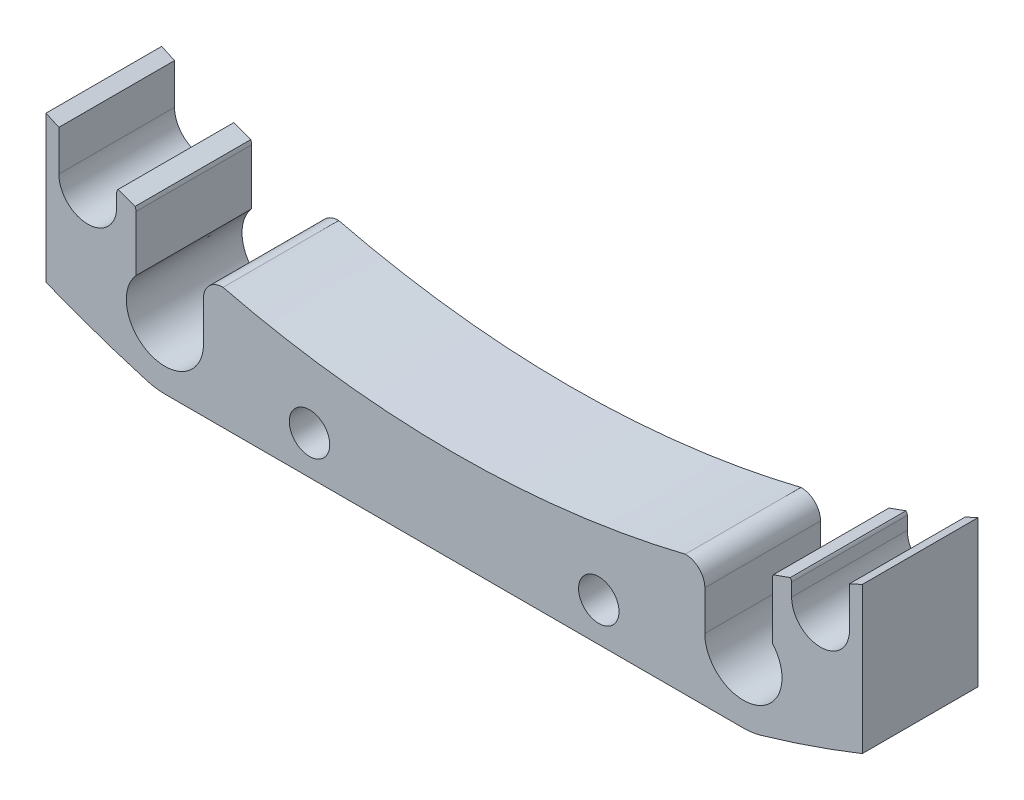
ISO-10303-21;
HEADER;
FILE_DESCRIPTION(('STEP AP214'),'2;1');
FILE_NAME('part.step','',(''),(''),'','','');
FILE_SCHEMA(('AUTOMOTIVE_DESIGN { 1 0 10303 214 1 1 1 1 }'));
ENDSEC;
DATA;
#1=APPLICATION_CONTEXT('core data for automotive mechanical design processes');
#2=APPLICATION_PROTOCOL_DEFINITION('international standard','automotive_design',2000,#1);
#3=PRODUCT_CONTEXT('',#1,'mechanical');
#4=PRODUCT('Part','Part','',(#3));
#5=PRODUCT_RELATED_PRODUCT_CATEGORY('part','',(#4));
#6=PRODUCT_DEFINITION_FORMATION('','',#4);
#7=PRODUCT_DEFINITION_CONTEXT('part definition',#1,'design');
#8=PRODUCT_DEFINITION('design','',#6,#7);
#9=PRODUCT_DEFINITION_SHAPE('','',#8);
#10=(LENGTH_UNIT() NAMED_UNIT(*) SI_UNIT(.MILLI.,.METRE.));
#11=(NAMED_UNIT(*) PLANE_ANGLE_UNIT() SI_UNIT($,.RADIAN.));
#12=(NAMED_UNIT(*) SI_UNIT($,.STERADIAN.) SOLID_ANGLE_UNIT());
#13=UNCERTAINTY_MEASURE_WITH_UNIT(LENGTH_MEASURE(1.E-05),#10,'distance_accuracy_value','');
#14=(GEOMETRIC_REPRESENTATION_CONTEXT(3) GLOBAL_UNCERTAINTY_ASSIGNED_CONTEXT((#13)) GLOBAL_UNIT_ASSIGNED_CONTEXT((#10,
#11,#12)) REPRESENTATION_CONTEXT('',''));
#15=CARTESIAN_POINT('',(0.,0.,0.));
#16=DIRECTION('',(0.,0.,1.));
#17=DIRECTION('',(1.,0.,0.));
#18=AXIS2_PLACEMENT_3D('',#15,#16,#17);
#19=CARTESIAN_POINT('',(-7810.81203155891,-23914.1952613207,-27409.4494534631));
#20=DIRECTION('',(-1.,0.,0.));
#21=DIRECTION('',(0.,1.,0.));
#22=AXIS2_PLACEMENT_3D('',#19,#20,#21);
#23=PLANE('',#22);
#24=DIRECTION('',(0.,-1.,0.));
#25=VECTOR('',#24,1.);
#26=CARTESIAN_POINT('',(-7810.81203155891,-23922.6589887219,-27265.7995516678));
#27=LINE('',#26,#25);
#28=CARTESIAN_POINT('',(-7810.81203155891,-23914.1952613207,-27265.7995516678));
#29=VERTEX_POINT('',#28);
#30=CARTESIAN_POINT('',(-7810.81203155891,-23929.3943610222,-27265.7995516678));
#31=VERTEX_POINT('',#30);
#32=EDGE_CURVE('E505',#29,#31,#27,.T.);
#33=ORIENTED_EDGE('',*,*,#32,.F.);
#34=DIRECTION('',(0.,0.,1.));
#35=VECTOR('',#34,1.);
#36=CARTESIAN_POINT('',(-7810.81203155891,-23914.1952613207,-27277.7995516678));
#37=LINE('',#36,#35);
#38=CARTESIAN_POINT('',(-7810.81203155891,-23914.1952613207,-27277.7995516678));
#39=VERTEX_POINT('',#38);
#40=EDGE_CURVE('E349',#39,#29,#37,.T.);
#41=ORIENTED_EDGE('',*,*,#40,.F.);
#42=DIRECTION('',(0.,-1.,0.));
#43=VECTOR('',#42,1.);
#44=CARTESIAN_POINT('',(-7810.81203155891,-23922.6589887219,-27277.7995516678));
#45=LINE('',#44,#43);
#46=CARTESIAN_POINT('',(-7810.81203155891,-23929.3943610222,-27277.7995516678));
#47=VERTEX_POINT('',#46);
#48=EDGE_CURVE('E608',#39,#47,#45,.T.);
#49=ORIENTED_EDGE('',*,*,#48,.T.);
#50=DIRECTION('',(0.,0.,1.));
#51=VECTOR('',#50,1.);
#52=CARTESIAN_POINT('',(-7810.81203155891,-23929.3943610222,-27409.4494534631));
#53=LINE('',#52,#51);
#54=EDGE_CURVE('E280',#47,#31,#53,.T.);
#55=ORIENTED_EDGE('',*,*,#54,.T.);
#56=EDGE_LOOP('',(#33,#41,#49,#55));
#57=FACE_BOUND('',#56,.T.);
#58=ADVANCED_FACE('F17',(#57),#23,.T.);
#59=CARTESIAN_POINT('',(-7726.14680557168,-23914.1952613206,-27428.9103864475));
#60=DIRECTION('',(-1.,0.,0.));
#61=DIRECTION('',(0.,0.,1.));
#62=AXIS2_PLACEMENT_3D('',#59,#60,#61);
#63=PLANE('',#62);
#64=DIRECTION('',(0.,0.,-1.));
#65=VECTOR('',#64,1.);
#66=CARTESIAN_POINT('',(-7726.14680557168,-23914.1952613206,-27265.7995516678));
#67=LINE('',#66,#65);
#68=CARTESIAN_POINT('',(-7726.14680557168,-23914.1952613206,-27265.7995516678));
#69=VERTEX_POINT('',#68);
#70=CARTESIAN_POINT('',(-7726.14680557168,-23914.1952613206,-27277.7995516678));
#71=VERTEX_POINT('',#70);
#72=EDGE_CURVE('E342',#69,#71,#67,.T.);
#73=ORIENTED_EDGE('',*,*,#72,.F.);
#74=DIRECTION('',(0.,-1.,0.));
#75=VECTOR('',#74,1.);
#76=CARTESIAN_POINT('',(-7726.14680557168,-23922.6589887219,-27265.7995516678));
#77=LINE('',#76,#75);
#78=CARTESIAN_POINT('',(-7726.14680557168,-23929.3943610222,-27265.7995516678));
#79=VERTEX_POINT('',#78);
#80=EDGE_CURVE('E537',#69,#79,#77,.T.);
#81=ORIENTED_EDGE('',*,*,#80,.T.);
#82=DIRECTION('',(0.,0.,1.));
#83=VECTOR('',#82,1.);
#84=CARTESIAN_POINT('',(-7726.14680557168,-23929.3943610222,-27428.9103864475));
#85=LINE('',#84,#83);
#86=CARTESIAN_POINT('',(-7726.14680557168,-23929.3943610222,-27277.7995516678));
#87=VERTEX_POINT('',#86);
#88=EDGE_CURVE('E317',#87,#79,#85,.T.);
#89=ORIENTED_EDGE('',*,*,#88,.F.);
#90=DIRECTION('',(0.,-1.,0.));
#91=VECTOR('',#90,1.);
#92=CARTESIAN_POINT('',(-7726.14680557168,-23922.6589887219,-27277.7995516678));
#93=LINE('',#92,#91);
#94=EDGE_CURVE('E297',#71,#87,#93,.T.);
#95=ORIENTED_EDGE('',*,*,#94,.F.);
#96=EDGE_LOOP('',(#73,#81,#89,#95));
#97=FACE_BOUND('',#96,.T.);
#98=ADVANCED_FACE('F779',(#97),#63,.F.);
#99=CARTESIAN_POINT('',(-7801.47941856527,-23924.1197642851,-27265.7995516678));
#100=DIRECTION('',(-1.,0.,0.));
#101=DIRECTION('',(0.,0.,1.));
#102=AXIS2_PLACEMENT_3D('',#99,#100,#101);
#103=PLANE('',#102);
#104=DIRECTION('',(0.,1.,0.));
#105=VECTOR('',#104,1.);
#106=CARTESIAN_POINT('',(-7801.47941856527,-23924.1197642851,-27265.7995516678));
#107=LINE('',#106,#105);
#108=CARTESIAN_POINT('',(-7801.47941856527,-23924.1197642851,-27265.7995516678));
#109=VERTEX_POINT('',#108);
#110=CARTESIAN_POINT('',(-7801.47941856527,-23918.3707205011,-27265.7995516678));
#111=VERTEX_POINT('',#110);
#112=EDGE_CURVE('E407',#109,#111,#107,.T.);
#113=ORIENTED_EDGE('',*,*,#112,.F.);
#114=DIRECTION('',(0.,0.,1.));
#115=VECTOR('',#114,1.);
#116=CARTESIAN_POINT('',(-7801.47941856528,-23924.1197642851,-27271.7995516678));
#117=LINE('',#116,#115);
#118=CARTESIAN_POINT('',(-7801.47941856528,-23924.1197642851,-27277.7995516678));
#119=VERTEX_POINT('',#118);
#120=EDGE_CURVE('E368',#119,#109,#117,.T.);
#121=ORIENTED_EDGE('',*,*,#120,.F.);
#122=DIRECTION('',(0.,1.,0.));
#123=VECTOR('',#122,1.);
#124=CARTESIAN_POINT('',(-7801.47941856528,-23922.6589887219,-27277.7995516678));
#125=LINE('',#124,#123);
#126=CARTESIAN_POINT('',(-7801.47941856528,-23918.3707205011,-27277.7995516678));
#127=VERTEX_POINT('',#126);
#128=EDGE_CURVE('E273',#119,#127,#125,.T.);
#129=ORIENTED_EDGE('',*,*,#128,.T.);
#130=DIRECTION('',(0.,0.,-1.));
#131=VECTOR('',#130,1.);
#132=CARTESIAN_POINT('',(-7801.47941856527,-23918.3707205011,-27265.7995516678));
#133=LINE('',#132,#131);
#134=EDGE_CURVE('E11',#111,#127,#133,.T.);
#135=ORIENTED_EDGE('',*,*,#134,.F.);
#136=EDGE_LOOP('',(#113,#121,#129,#135));
#137=FACE_BOUND('',#136,.T.);
#138=ADVANCED_FACE('F784',(#137),#103,.F.);
#139=CARTESIAN_POINT('',(-7802.47941856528,-23918.3707205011,-27317.7283864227));
#140=DIRECTION('',(0.,0.,1.));
#141=DIRECTION('',(0.,-1.,0.));
#142=AXIS2_PLACEMENT_3D('',#139,#140,#141);
#143=CYLINDRICAL_SURFACE('',#142,1.00000000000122);
#144=CARTESIAN_POINT('',(-7802.47941856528,-23918.3707205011,-27265.7995516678));
#145=DIRECTION('',(0.,0.,-1.));
#146=DIRECTION('',(1.,4.61852778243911E-11,0.));
#147=AXIS2_PLACEMENT_3D('',#144,#145,#146);
#148=CIRCLE('',#147,1.00000000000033);
#149=CARTESIAN_POINT('',(-7801.57193496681,-23917.9506329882,-27265.7995516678));
#150=VERTEX_POINT('',#149);
#151=EDGE_CURVE('E490',#150,#111,#148,.T.);
#152=ORIENTED_EDGE('',*,*,#151,.T.);
#153=ORIENTED_EDGE('',*,*,#134,.T.);
#154=CARTESIAN_POINT('',(-7802.47941856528,-23918.3707205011,-27277.7995516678));
#155=DIRECTION('',(0.,0.,1.));
#156=DIRECTION('',(1.,0.,0.));
#157=AXIS2_PLACEMENT_3D('',#154,#155,#156);
#158=CIRCLE('',#157,1.00000000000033);
#159=CARTESIAN_POINT('',(-7801.57193496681,-23917.9506329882,-27277.7995516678));
#160=VERTEX_POINT('',#159);
#161=EDGE_CURVE('E631',#127,#160,#158,.T.);
#162=ORIENTED_EDGE('',*,*,#161,.T.);
#163=DIRECTION('',(0.,0.,-1.));
#164=VECTOR('',#163,1.);
#165=CARTESIAN_POINT('',(-7801.57193496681,-23917.9506329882,-27265.7995516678));
#166=LINE('',#165,#164);
#167=EDGE_CURVE('E346',#150,#160,#166,.T.);
#168=ORIENTED_EDGE('',*,*,#167,.F.);
#169=EDGE_LOOP('',(#152,#153,#162,#168));
#170=FACE_BOUND('',#169,.T.);
#171=ADVANCED_FACE('F1673',(#170),#143,.T.);
#172=CARTESIAN_POINT('',(-7802.97941856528,-23917.6583119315,-27317.7283864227));
#173=DIRECTION('',(0.,0.,1.));
#174=DIRECTION('',(0.,-1.,0.));
#175=AXIS2_PLACEMENT_3D('',#172,#173,#174);
#176=CYLINDRICAL_SURFACE('',#175,0.499999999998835);
#177=CARTESIAN_POINT('',(-7802.97941856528,-23917.6583119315,-27277.7995516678));
#178=DIRECTION('',(0.,0.,1.));
#179=DIRECTION('',(1.,0.,0.));
#180=AXIS2_PLACEMENT_3D('',#177,#178,#179);
#181=CIRCLE('',#180,0.499999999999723);
#182=CARTESIAN_POINT('',(-7803.34148871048,-23917.3134855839,-27277.7995516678));
#183=VERTEX_POINT('',#182);
#184=CARTESIAN_POINT('',(-7803.47941856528,-23917.6583119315,-27277.7995516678));
#185=VERTEX_POINT('',#184);
#186=EDGE_CURVE('E515',#183,#185,#181,.T.);
#187=ORIENTED_EDGE('',*,*,#186,.T.);
#188=DIRECTION('',(0.,0.,1.));
#189=VECTOR('',#188,1.);
#190=CARTESIAN_POINT('',(-7803.47941856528,-23917.6583119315,-27317.7283864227));
#191=LINE('',#190,#189);
#192=CARTESIAN_POINT('',(-7803.47941856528,-23917.6583119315,-27265.7995516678));
#193=VERTEX_POINT('',#192);
#194=EDGE_CURVE('E36',#185,#193,#191,.T.);
#195=ORIENTED_EDGE('',*,*,#194,.T.);
#196=CARTESIAN_POINT('',(-7802.97941856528,-23917.6583119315,-27265.7995516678));
#197=DIRECTION('',(0.,0.,-1.));
#198=DIRECTION('',(1.,7.10542735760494E-12,0.));
#199=AXIS2_PLACEMENT_3D('',#196,#197,#198);
#200=CIRCLE('',#199,0.499999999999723);
#201=CARTESIAN_POINT('',(-7803.34148871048,-23917.3134855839,-27265.7995516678));
#202=VERTEX_POINT('',#201);
#203=EDGE_CURVE('E594',#193,#202,#200,.T.);
#204=ORIENTED_EDGE('',*,*,#203,.T.);
#205=DIRECTION('',(0.,0.,1.));
#206=VECTOR('',#205,1.);
#207=CARTESIAN_POINT('',(-7803.34148871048,-23917.3134855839,-27277.7995516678));
#208=LINE('',#207,#206);
#209=EDGE_CURVE('E350',#183,#202,#208,.T.);
#210=ORIENTED_EDGE('',*,*,#209,.F.);
#211=EDGE_LOOP('',(#187,#195,#204,#210));
#212=FACE_BOUND('',#211,.T.);
#213=ADVANCED_FACE('F760',(#212),#176,.T.);
#214=CARTESIAN_POINT('',(-7803.47941856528,-23918.9995220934,-27317.7283864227));
#215=DIRECTION('',(1.,0.,0.));
#216=DIRECTION('',(0.,1.,0.));
#217=AXIS2_PLACEMENT_3D('',#214,#215,#216);
#218=PLANE('',#217);
#219=DIRECTION('',(0.,0.,1.));
#220=VECTOR('',#219,1.);
#221=CARTESIAN_POINT('',(-7803.47941856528,-23918.9995220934,-27317.7283864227));
#222=LINE('',#221,#220);
#223=CARTESIAN_POINT('',(-7803.47941856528,-23918.9995220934,-27277.7995516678));
#224=VERTEX_POINT('',#223);
#225=CARTESIAN_POINT('',(-7803.47941856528,-23918.9995220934,-27265.7995516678));
#226=VERTEX_POINT('',#225);
#227=EDGE_CURVE('E486',#224,#226,#222,.T.);
#228=ORIENTED_EDGE('',*,*,#227,.T.);
#229=DIRECTION('',(0.,-1.,0.));
#230=VECTOR('',#229,1.);
#231=CARTESIAN_POINT('',(-7803.47941856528,-23918.9995220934,-27265.7995516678));
#232=LINE('',#231,#230);
#233=EDGE_CURVE('E598',#193,#226,#232,.T.);
#234=ORIENTED_EDGE('',*,*,#233,.F.);
#235=ORIENTED_EDGE('',*,*,#194,.F.);
#236=DIRECTION('',(0.,-1.,0.));
#237=VECTOR('',#236,1.);
#238=CARTESIAN_POINT('',(-7803.47941856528,-23922.6589887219,-27277.7995516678));
#239=LINE('',#238,#237);
#240=EDGE_CURVE('E511',#185,#224,#239,.T.);
#241=ORIENTED_EDGE('',*,*,#240,.T.);
#242=EDGE_LOOP('',(#228,#234,#235,#241));
#243=FACE_BOUND('',#242,.T.);
#244=ADVANCED_FACE('F735',(#243),#218,.F.);
#245=CARTESIAN_POINT('',(-7809.47941856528,-23918.9995220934,-27317.7283864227));
#246=DIRECTION('',(-1.,0.,0.));
#247=DIRECTION('',(0.,0.,1.));
#248=AXIS2_PLACEMENT_3D('',#245,#246,#247);
#249=PLANE('',#248);
#250=DIRECTION('',(0.,1.,0.));
#251=VECTOR('',#250,1.);
#252=CARTESIAN_POINT('',(-7809.47941856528,-23918.9995220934,-27265.7995516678));
#253=LINE('',#252,#251);
#254=CARTESIAN_POINT('',(-7809.47941856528,-23918.9995220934,-27265.7995516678));
#255=VERTEX_POINT('',#254);
#256=CARTESIAN_POINT('',(-7809.47941856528,-23914.8038616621,-27265.7995516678));
#257=VERTEX_POINT('',#256);
#258=EDGE_CURVE('E605',#255,#257,#253,.T.);
#259=ORIENTED_EDGE('',*,*,#258,.F.);
#260=DIRECTION('',(0.,0.,1.));
#261=VECTOR('',#260,1.);
#262=CARTESIAN_POINT('',(-7809.47941856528,-23918.9995220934,-27317.7283864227));
#263=LINE('',#262,#261);
#264=CARTESIAN_POINT('',(-7809.47941856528,-23918.9995220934,-27277.7995516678));
#265=VERTEX_POINT('',#264);
#266=EDGE_CURVE('E359',#265,#255,#263,.T.);
#267=ORIENTED_EDGE('',*,*,#266,.F.);
#268=DIRECTION('',(0.,-1.,0.));
#269=VECTOR('',#268,1.);
#270=CARTESIAN_POINT('',(-7809.47941856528,-23918.9995220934,-27277.7995516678));
#271=LINE('',#270,#269);
#272=CARTESIAN_POINT('',(-7809.47941856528,-23914.8038616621,-27277.7995516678));
#273=VERTEX_POINT('',#272);
#274=EDGE_CURVE('E516',#273,#265,#271,.T.);
#275=ORIENTED_EDGE('',*,*,#274,.F.);
#276=DIRECTION('',(0.,0.,-1.));
#277=VECTOR('',#276,1.);
#278=CARTESIAN_POINT('',(-7809.47941856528,-23914.8038616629,-7.63282033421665E-10));
#279=LINE('',#278,#277);
#280=EDGE_CURVE('E341',#257,#273,#279,.T.);
#281=ORIENTED_EDGE('',*,*,#280,.F.);
#282=EDGE_LOOP('',(#259,#267,#275,#281));
#283=FACE_BOUND('',#282,.T.);
#284=ADVANCED_FACE('F743',(#283),#249,.F.);
#285=CARTESIAN_POINT('',(-7768.47941856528,-23823.2655155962,-27317.7283864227));
#286=DIRECTION('',(0.,0.,1.));
#287=DIRECTION('',(0.,-1.,0.));
#288=AXIS2_PLACEMENT_3D('',#285,#286,#287);
#289=CYLINDRICAL_SURFACE('',#288,114.260150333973);
#290=ORIENTED_EDGE('',*,*,#54,.F.);
#291=CARTESIAN_POINT('',(-7768.47941856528,-23823.2655155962,-27277.7995516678));
#292=DIRECTION('',(0.,0.,1.));
#293=DIRECTION('',(1.,0.,0.));
#294=AXIS2_PLACEMENT_3D('',#291,#292,#293);
#295=CIRCLE('',#294,114.260150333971);
#296=CARTESIAN_POINT('',(-7800.28899287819,-23933.0085469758,-27277.7995516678));
#297=VERTEX_POINT('',#296);
#298=EDGE_CURVE('E314',#47,#297,#295,.T.);
#299=ORIENTED_EDGE('',*,*,#298,.T.);
#300=DIRECTION('',(0.,0.,1.));
#301=VECTOR('',#300,1.);
#302=CARTESIAN_POINT('',(-7800.28899287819,-23933.0085469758,-27265.7995516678));
#303=LINE('',#302,#301);
#304=CARTESIAN_POINT('',(-7800.28899287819,-23933.0085469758,-27265.7995516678));
#305=VERTEX_POINT('',#304);
#306=EDGE_CURVE('E51',#297,#305,#303,.T.);
#307=ORIENTED_EDGE('',*,*,#306,.T.);
#308=CARTESIAN_POINT('',(-7768.47941856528,-23823.2655155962,-27265.7995516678));
#309=DIRECTION('',(0.,0.,1.));
#310=DIRECTION('',(1.,0.,0.));
#311=AXIS2_PLACEMENT_3D('',#308,#309,#310);
#312=CIRCLE('',#311,114.260150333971);
#313=EDGE_CURVE('E500',#31,#305,#312,.T.);
#314=ORIENTED_EDGE('',*,*,#313,.F.);
#315=EDGE_LOOP('',(#290,#299,#307,#314));
#316=FACE_BOUND('',#315,.T.);
#317=ADVANCED_FACE('F694',(#316),#289,.T.);
#318=CARTESIAN_POINT('',(-7798.47941856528,-23926.7655155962,-27265.7995516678));
#319=DIRECTION('',(0.,0.,-1.));
#320=DIRECTION('',(0.,1.,0.));
#321=AXIS2_PLACEMENT_3D('',#318,#319,#320);
#322=CYLINDRICAL_SURFACE('',#321,6.49999999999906);
#323=ORIENTED_EDGE('',*,*,#306,.F.);
#324=CARTESIAN_POINT('',(-7798.47941856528,-23926.7655155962,-27277.7995516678));
#325=DIRECTION('',(0.,0.,1.));
#326=DIRECTION('',(-1.,0.,0.));
#327=AXIS2_PLACEMENT_3D('',#324,#325,#326);
#328=CIRCLE('',#327,6.5);
#329=CARTESIAN_POINT('',(-7798.47941856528,-23933.2655155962,-27277.7995516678));
#330=VERTEX_POINT('',#329);
#331=EDGE_CURVE('E303',#297,#330,#328,.T.);
#332=ORIENTED_EDGE('',*,*,#331,.T.);
#333=DIRECTION('',(0.,0.,1.));
#334=VECTOR('',#333,1.);
#335=CARTESIAN_POINT('',(-7798.47941856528,-23933.2655155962,-27265.7995516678));
#336=LINE('',#335,#334);
#337=CARTESIAN_POINT('',(-7798.47941856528,-23933.2655155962,-27265.7995516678));
#338=VERTEX_POINT('',#337);
#339=EDGE_CURVE('E281',#330,#338,#336,.T.);
#340=ORIENTED_EDGE('',*,*,#339,.T.);
#341=CARTESIAN_POINT('',(-7798.47941856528,-23926.7655155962,-27265.7995516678));
#342=DIRECTION('',(0.,0.,-1.));
#343=DIRECTION('',(-1.,0.,0.));
#344=AXIS2_PLACEMENT_3D('',#341,#342,#343);
#345=CIRCLE('',#344,6.5);
#346=EDGE_CURVE('E504',#338,#305,#345,.T.);
#347=ORIENTED_EDGE('',*,*,#346,.T.);
#348=EDGE_LOOP('',(#323,#332,#340,#347));
#349=FACE_BOUND('',#348,.T.);
#350=ADVANCED_FACE('F698',(#349),#322,.T.);
#351=CARTESIAN_POINT('',(-7738.47941856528,-23933.2655155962,-27265.7995516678));
#352=DIRECTION('',(0.,1.,0.));
#353=DIRECTION('',(1.,0.,0.));
#354=AXIS2_PLACEMENT_3D('',#351,#352,#353);
#355=PLANE('',#354);
#356=DIRECTION('',(1.,0.,0.));
#357=VECTOR('',#356,1.);
#358=CARTESIAN_POINT('',(-7738.47941856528,-23933.2655155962,-27265.7995516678));
#359=LINE('',#358,#357);
#360=CARTESIAN_POINT('',(-7738.47941856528,-23933.2655155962,-27265.7995516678));
#361=VERTEX_POINT('',#360);
#362=EDGE_CURVE('E525',#338,#361,#359,.T.);
#363=ORIENTED_EDGE('',*,*,#362,.F.);
#364=ORIENTED_EDGE('',*,*,#339,.F.);
#365=DIRECTION('',(1.,0.,0.));
#366=VECTOR('',#365,1.);
#367=CARTESIAN_POINT('',(-7744.47941856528,-23933.2655155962,-27277.7995516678));
#368=LINE('',#367,#366);
#369=CARTESIAN_POINT('',(-7738.47941856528,-23933.2655155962,-27277.7995516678));
#370=VERTEX_POINT('',#369);
#371=EDGE_CURVE('E299',#330,#370,#368,.T.);
#372=ORIENTED_EDGE('',*,*,#371,.T.);
#373=DIRECTION('',(0.,0.,-1.));
#374=VECTOR('',#373,1.);
#375=CARTESIAN_POINT('',(-7738.47941856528,-23933.2655155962,-27265.7995516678));
#376=LINE('',#375,#374);
#377=EDGE_CURVE('E318',#361,#370,#376,.T.);
#378=ORIENTED_EDGE('',*,*,#377,.F.);
#379=EDGE_LOOP('',(#363,#364,#372,#378));
#380=FACE_BOUND('',#379,.T.);
#381=ADVANCED_FACE('F710',(#380),#355,.F.);
#382=CARTESIAN_POINT('',(-7738.47941856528,-23926.7655155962,-27265.7995516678));
#383=DIRECTION('',(0.,0.,-1.));
#384=DIRECTION('',(0.,1.,0.));
#385=AXIS2_PLACEMENT_3D('',#382,#383,#384);
#386=CYLINDRICAL_SURFACE('',#385,6.49999999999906);
#387=CARTESIAN_POINT('',(-7738.47941856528,-23926.7655155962,-27277.7995516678));
#388=DIRECTION('',(0.,0.,1.));
#389=DIRECTION('',(-1.,0.,0.));
#390=AXIS2_PLACEMENT_3D('',#387,#388,#389);
#391=CIRCLE('',#390,6.5);
#392=CARTESIAN_POINT('',(-7736.66984425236,-23933.0085469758,-27277.7995516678));
#393=VERTEX_POINT('',#392);
#394=EDGE_CURVE('E304',#370,#393,#391,.T.);
#395=ORIENTED_EDGE('',*,*,#394,.T.);
#396=DIRECTION('',(0.,0.,-1.));
#397=VECTOR('',#396,1.);
#398=CARTESIAN_POINT('',(-7736.66984425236,-23933.0085469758,-27265.7995516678));
#399=LINE('',#398,#397);
#400=CARTESIAN_POINT('',(-7736.66984425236,-23933.0085469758,-27265.7995516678));
#401=VERTEX_POINT('',#400);
#402=EDGE_CURVE('E323',#401,#393,#399,.T.);
#403=ORIENTED_EDGE('',*,*,#402,.F.);
#404=CARTESIAN_POINT('',(-7738.47941856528,-23926.7655155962,-27265.7995516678));
#405=DIRECTION('',(0.,0.,-1.));
#406=DIRECTION('',(-1.,0.,0.));
#407=AXIS2_PLACEMENT_3D('',#404,#405,#406);
#408=CIRCLE('',#407,6.5);
#409=EDGE_CURVE('E529',#401,#361,#408,.T.);
#410=ORIENTED_EDGE('',*,*,#409,.T.);
#411=ORIENTED_EDGE('',*,*,#377,.T.);
#412=EDGE_LOOP('',(#395,#403,#410,#411));
#413=FACE_BOUND('',#412,.T.);
#414=ADVANCED_FACE('F1493',(#413),#386,.T.);
#415=CARTESIAN_POINT('',(-7727.47941856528,-23918.9995220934,-27317.7283864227));
#416=DIRECTION('',(-1.,0.,0.));
#417=DIRECTION('',(0.,1.,0.));
#418=AXIS2_PLACEMENT_3D('',#415,#416,#417);
#419=PLANE('',#418);
#420=DIRECTION('',(0.,-1.,0.));
#421=VECTOR('',#420,1.);
#422=CARTESIAN_POINT('',(-7727.47941856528,-23922.6589887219,-27277.7995516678));
#423=LINE('',#422,#421);
#424=CARTESIAN_POINT('',(-7727.47941856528,-23914.803861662,-27277.7995516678));
#425=VERTEX_POINT('',#424);
#426=CARTESIAN_POINT('',(-7727.47941856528,-23918.9995220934,-27277.7995516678));
#427=VERTEX_POINT('',#426);
#428=EDGE_CURVE('E298',#425,#427,#423,.T.);
#429=ORIENTED_EDGE('',*,*,#428,.T.);
#430=DIRECTION('',(0.,0.,1.));
#431=VECTOR('',#430,1.);
#432=CARTESIAN_POINT('',(-7727.47941856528,-23918.9995220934,-27317.7283864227));
#433=LINE('',#432,#431);
#434=CARTESIAN_POINT('',(-7727.47941856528,-23918.9995220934,-27265.7995516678));
#435=VERTEX_POINT('',#434);
#436=EDGE_CURVE('E476',#427,#435,#433,.T.);
#437=ORIENTED_EDGE('',*,*,#436,.T.);
#438=DIRECTION('',(0.,1.,0.));
#439=VECTOR('',#438,1.);
#440=CARTESIAN_POINT('',(-7727.47941856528,-23922.6589887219,-27265.7995516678));
#441=LINE('',#440,#439);
#442=CARTESIAN_POINT('',(-7727.47941856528,-23914.803861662,-27265.7995516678));
#443=VERTEX_POINT('',#442);
#444=EDGE_CURVE('E551',#435,#443,#441,.T.);
#445=ORIENTED_EDGE('',*,*,#444,.T.);
#446=DIRECTION('',(0.,0.,1.));
#447=VECTOR('',#446,1.);
#448=CARTESIAN_POINT('',(-7727.47941856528,-23914.803861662,-27317.7283864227));
#449=LINE('',#448,#447);
#450=EDGE_CURVE('E345',#425,#443,#449,.T.);
#451=ORIENTED_EDGE('',*,*,#450,.F.);
#452=EDGE_LOOP('',(#429,#437,#445,#451));
#453=FACE_BOUND('',#452,.T.);
#454=ADVANCED_FACE('F1497',(#453),#419,.T.);
#455=CARTESIAN_POINT('',(-7733.47941856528,-23918.9995220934,-27317.7283864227));
#456=DIRECTION('',(1.,0.,0.));
#457=DIRECTION('',(0.,1.,0.));
#458=AXIS2_PLACEMENT_3D('',#455,#456,#457);
#459=PLANE('',#458);
#460=DIRECTION('',(0.,1.,0.));
#461=VECTOR('',#460,1.);
#462=CARTESIAN_POINT('',(-7733.47941856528,-23922.6589887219,-27277.7995516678));
#463=LINE('',#462,#461);
#464=CARTESIAN_POINT('',(-7733.47941856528,-23918.9995220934,-27277.7995516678));
#465=VERTEX_POINT('',#464);
#466=CARTESIAN_POINT('',(-7733.47941856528,-23917.6583119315,-27277.7995516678));
#467=VERTEX_POINT('',#466);
#468=EDGE_CURVE('E286',#465,#467,#463,.T.);
#469=ORIENTED_EDGE('',*,*,#468,.T.);
#470=DIRECTION('',(0.,0.,-1.));
#471=VECTOR('',#470,1.);
#472=CARTESIAN_POINT('',(-7733.47941856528,-23917.6583119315,-27317.7283864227));
#473=LINE('',#472,#471);
#474=CARTESIAN_POINT('',(-7733.47941856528,-23917.6583119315,-27265.7995516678));
#475=VERTEX_POINT('',#474);
#476=EDGE_CURVE('E291',#475,#467,#473,.T.);
#477=ORIENTED_EDGE('',*,*,#476,.F.);
#478=DIRECTION('',(0.,1.,0.));
#479=VECTOR('',#478,1.);
#480=CARTESIAN_POINT('',(-7733.47941856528,-23918.9995220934,-27265.7995516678));
#481=LINE('',#480,#479);
#482=CARTESIAN_POINT('',(-7733.47941856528,-23918.9995220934,-27265.7995516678));
#483=VERTEX_POINT('',#482);
#484=EDGE_CURVE('E555',#483,#475,#481,.T.);
#485=ORIENTED_EDGE('',*,*,#484,.F.);
#486=DIRECTION('',(0.,0.,-1.));
#487=VECTOR('',#486,1.);
#488=CARTESIAN_POINT('',(-7733.47941856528,-23918.9995220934,-27317.7283864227));
#489=LINE('',#488,#487);
#490=EDGE_CURVE('E322',#483,#465,#489,.T.);
#491=ORIENTED_EDGE('',*,*,#490,.T.);
#492=EDGE_LOOP('',(#469,#477,#485,#491));
#493=FACE_BOUND('',#492,.T.);
#494=ADVANCED_FACE('F1606',(#493),#459,.T.);
#495=CARTESIAN_POINT('',(-7733.97941856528,-23917.6583119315,-27317.7283864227));
#496=DIRECTION('',(0.,0.,1.));
#497=DIRECTION('',(0.,-1.,0.));
#498=AXIS2_PLACEMENT_3D('',#495,#496,#497);
#499=CYLINDRICAL_SURFACE('',#498,0.499999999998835);
#500=CARTESIAN_POINT('',(-7733.97941856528,-23917.6583119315,-27265.7995516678));
#501=DIRECTION('',(0.,0.,-1.));
#502=DIRECTION('',(1.,0.,0.));
#503=AXIS2_PLACEMENT_3D('',#500,#501,#502);
#504=CIRCLE('',#503,0.499999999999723);
#505=CARTESIAN_POINT('',(-7733.61734842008,-23917.3134855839,-27265.7995516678));
#506=VERTEX_POINT('',#505);
#507=EDGE_CURVE('E543',#506,#475,#504,.T.);
#508=ORIENTED_EDGE('',*,*,#507,.T.);
#509=ORIENTED_EDGE('',*,*,#476,.T.);
#510=CARTESIAN_POINT('',(-7733.97941856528,-23917.6583119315,-27277.7995516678));
#511=DIRECTION('',(0.,0.,1.));
#512=DIRECTION('',(1.,0.,0.));
#513=AXIS2_PLACEMENT_3D('',#510,#511,#512);
#514=CIRCLE('',#513,0.499999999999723);
#515=CARTESIAN_POINT('',(-7733.61734842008,-23917.3134855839,-27277.7995516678));
#516=VERTEX_POINT('',#515);
#517=EDGE_CURVE('E282',#467,#516,#514,.T.);
#518=ORIENTED_EDGE('',*,*,#517,.T.);
#519=DIRECTION('',(0.,0.,-1.));
#520=VECTOR('',#519,1.);
#521=CARTESIAN_POINT('',(-7733.61734842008,-23917.3134855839,-27265.7995516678));
#522=LINE('',#521,#520);
#523=EDGE_CURVE('E337',#506,#516,#522,.T.);
#524=ORIENTED_EDGE('',*,*,#523,.F.);
#525=EDGE_LOOP('',(#508,#509,#518,#524));
#526=FACE_BOUND('',#525,.T.);
#527=ADVANCED_FACE('F1407',(#526),#499,.T.);
#528=CARTESIAN_POINT('',(-7734.47941856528,-23918.3707205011,-27317.7283864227));
#529=DIRECTION('',(0.,0.,1.));
#530=DIRECTION('',(0.,-1.,0.));
#531=AXIS2_PLACEMENT_3D('',#528,#529,#530);
#532=CYLINDRICAL_SURFACE('',#531,1.00000000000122);
#533=CARTESIAN_POINT('',(-7734.47941856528,-23918.3707205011,-27277.7995516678));
#534=DIRECTION('',(0.,0.,1.));
#535=DIRECTION('',(1.,0.,0.));
#536=AXIS2_PLACEMENT_3D('',#533,#534,#535);
#537=CIRCLE('',#536,1.00000000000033);
#538=CARTESIAN_POINT('',(-7735.38690216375,-23917.9506329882,-27277.7995516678));
#539=VERTEX_POINT('',#538);
#540=CARTESIAN_POINT('',(-7735.47941856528,-23918.3707205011,-27277.7995516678));
#541=VERTEX_POINT('',#540);
#542=EDGE_CURVE('E586',#539,#541,#537,.T.);
#543=ORIENTED_EDGE('',*,*,#542,.T.);
#544=DIRECTION('',(0.,0.,1.));
#545=VECTOR('',#544,1.);
#546=CARTESIAN_POINT('',(-7735.47941856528,-23918.3707205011,-27265.7995516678));
#547=LINE('',#546,#545);
#548=CARTESIAN_POINT('',(-7735.47941856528,-23918.3707205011,-27265.7995516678));
#549=VERTEX_POINT('',#548);
#550=EDGE_CURVE('E288',#541,#549,#547,.T.);
#551=ORIENTED_EDGE('',*,*,#550,.T.);
#552=CARTESIAN_POINT('',(-7734.47941856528,-23918.3707205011,-27265.7995516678));
#553=DIRECTION('',(0.,0.,-1.));
#554=DIRECTION('',(1.,0.,0.));
#555=AXIS2_PLACEMENT_3D('',#552,#553,#554);
#556=CIRCLE('',#555,1.00000000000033);
#557=CARTESIAN_POINT('',(-7735.38690216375,-23917.9506329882,-27265.7995516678));
#558=VERTEX_POINT('',#557);
#559=EDGE_CURVE('E542',#549,#558,#556,.T.);
#560=ORIENTED_EDGE('',*,*,#559,.T.);
#561=DIRECTION('',(0.,0.,1.));
#562=VECTOR('',#561,1.);
#563=CARTESIAN_POINT('',(-7735.38690216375,-23917.9506329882,-27277.7995516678));
#564=LINE('',#563,#562);
#565=EDGE_CURVE('E334',#539,#558,#564,.T.);
#566=ORIENTED_EDGE('',*,*,#565,.F.);
#567=EDGE_LOOP('',(#543,#551,#560,#566));
#568=FACE_BOUND('',#567,.T.);
#569=ADVANCED_FACE('F1401',(#568),#532,.T.);
#570=CARTESIAN_POINT('',(-7735.47941856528,-23924.1197642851,-27265.7995516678));
#571=DIRECTION('',(1.,0.,0.));
#572=DIRECTION('',(0.,1.,0.));
#573=AXIS2_PLACEMENT_3D('',#570,#571,#572);
#574=PLANE('',#573);
#575=DIRECTION('',(0.,-1.,0.));
#576=VECTOR('',#575,1.);
#577=CARTESIAN_POINT('',(-7735.47941856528,-23924.1197642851,-27265.7995516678));
#578=LINE('',#577,#576);
#579=CARTESIAN_POINT('',(-7735.47941856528,-23924.1197642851,-27265.7995516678));
#580=VERTEX_POINT('',#579);
#581=EDGE_CURVE('E445',#549,#580,#578,.T.);
#582=ORIENTED_EDGE('',*,*,#581,.F.);
#583=ORIENTED_EDGE('',*,*,#550,.F.);
#584=DIRECTION('',(0.,-1.,0.));
#585=VECTOR('',#584,1.);
#586=CARTESIAN_POINT('',(-7735.47941856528,-23922.6589887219,-27277.7995516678));
#587=LINE('',#586,#585);
#588=CARTESIAN_POINT('',(-7735.47941856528,-23924.1197642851,-27277.7995516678));
#589=VERTEX_POINT('',#588);
#590=EDGE_CURVE('E384',#541,#589,#587,.T.);
#591=ORIENTED_EDGE('',*,*,#590,.T.);
#592=DIRECTION('',(4.4408920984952E-13,0.,1.));
#593=VECTOR('',#592,1.);
#594=CARTESIAN_POINT('',(-7735.47941856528,-23924.1197642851,-27271.7995516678));
#595=LINE('',#594,#593);
#596=EDGE_CURVE('E327',#589,#580,#595,.T.);
#597=ORIENTED_EDGE('',*,*,#596,.T.);
#598=EDGE_LOOP('',(#582,#583,#591,#597));
#599=FACE_BOUND('',#598,.T.);
#600=ADVANCED_FACE('F1406',(#599),#574,.F.);
#601=CARTESIAN_POINT('',(-7742.47941856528,-23926.7655155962,-27265.7995516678));
#602=DIRECTION('',(-1.,0.,0.));
#603=DIRECTION('',(0.,0.,1.));
#604=AXIS2_PLACEMENT_3D('',#601,#602,#603);
#605=PLANE('',#604);
#606=DIRECTION('',(0.,1.,0.));
#607=VECTOR('',#606,1.);
#608=CARTESIAN_POINT('',(-7742.47941856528,-23926.7655155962,-27265.7995516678));
#609=LINE('',#608,#607);
#610=CARTESIAN_POINT('',(-7742.47941856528,-23926.7655155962,-27265.7995516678));
#611=VERTEX_POINT('',#610);
#612=CARTESIAN_POINT('',(-7742.47941856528,-23922.6589887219,-27265.7995516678));
#613=VERTEX_POINT('',#612);
#614=EDGE_CURVE('E436',#611,#613,#609,.T.);
#615=ORIENTED_EDGE('',*,*,#614,.F.);
#616=DIRECTION('',(0.,-1.77635683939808E-12,-1.));
#617=VECTOR('',#616,1.);
#618=CARTESIAN_POINT('',(-7742.47941856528,-23926.7655155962,-27271.7995516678));
#619=LINE('',#618,#617);
#620=CARTESIAN_POINT('',(-7742.47941856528,-23926.7655155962,-27277.7995516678));
#621=VERTEX_POINT('',#620);
#622=EDGE_CURVE('E330',#611,#621,#619,.T.);
#623=ORIENTED_EDGE('',*,*,#622,.T.);
#624=DIRECTION('',(0.,1.,0.));
#625=VECTOR('',#624,1.);
#626=CARTESIAN_POINT('',(-7742.47941856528,-23922.6589887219,-27277.7995516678));
#627=LINE('',#626,#625);
#628=CARTESIAN_POINT('',(-7742.47941856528,-23922.6589887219,-27277.7995516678));
#629=VERTEX_POINT('',#628);
#630=EDGE_CURVE('E385',#621,#629,#627,.T.);
#631=ORIENTED_EDGE('',*,*,#630,.T.);
#632=DIRECTION('',(0.,0.,-1.));
#633=VECTOR('',#632,1.);
#634=CARTESIAN_POINT('',(-7742.47941856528,-23922.6589887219,-27265.7995516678));
#635=LINE('',#634,#633);
#636=EDGE_CURVE('E292',#613,#629,#635,.T.);
#637=ORIENTED_EDGE('',*,*,#636,.F.);
#638=EDGE_LOOP('',(#615,#623,#631,#637));
#639=FACE_BOUND('',#638,.T.);
#640=ADVANCED_FACE('F644',(#639),#605,.F.);
#641=CARTESIAN_POINT('',(-7794.47941856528,-23926.7655155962,-27265.7995516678));
#642=DIRECTION('',(1.,0.,0.));
#643=DIRECTION('',(0.,1.,0.));
#644=AXIS2_PLACEMENT_3D('',#641,#642,#643);
#645=PLANE('',#644);
#646=DIRECTION('',(0.,-1.,0.));
#647=VECTOR('',#646,1.);
#648=CARTESIAN_POINT('',(-7794.47941856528,-23926.7655155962,-27265.7995516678));
#649=LINE('',#648,#647);
#650=CARTESIAN_POINT('',(-7794.47941856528,-23922.6589887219,-27265.7995516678));
#651=VERTEX_POINT('',#650);
#652=CARTESIAN_POINT('',(-7794.47941856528,-23926.7655155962,-27265.7995516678));
#653=VERTEX_POINT('',#652);
#654=EDGE_CURVE('E408',#651,#653,#649,.T.);
#655=ORIENTED_EDGE('',*,*,#654,.F.);
#656=DIRECTION('',(0.,0.,1.));
#657=VECTOR('',#656,1.);
#658=CARTESIAN_POINT('',(-7794.47941856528,-23922.6589887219,-27265.7995516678));
#659=LINE('',#658,#657);
#660=CARTESIAN_POINT('',(-7794.47941856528,-23922.6589887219,-27277.7995516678));
#661=VERTEX_POINT('',#660);
#662=EDGE_CURVE('E468',#661,#651,#659,.T.);
#663=ORIENTED_EDGE('',*,*,#662,.F.);
#664=DIRECTION('',(0.,-1.,0.));
#665=VECTOR('',#664,1.);
#666=CARTESIAN_POINT('',(-7794.47941856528,-23922.6589887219,-27277.7995516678));
#667=LINE('',#666,#665);
#668=CARTESIAN_POINT('',(-7794.47941856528,-23926.7655155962,-27277.7995516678));
#669=VERTEX_POINT('',#668);
#670=EDGE_CURVE('E260',#661,#669,#667,.T.);
#671=ORIENTED_EDGE('',*,*,#670,.T.);
#672=DIRECTION('',(0.,1.77635683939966E-12,-1.));
#673=VECTOR('',#672,1.);
#674=CARTESIAN_POINT('',(-7794.47941856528,-23926.7655155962,-27271.7995516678));
#675=LINE('',#674,#673);
#676=EDGE_CURVE('E331',#653,#669,#675,.T.);
#677=ORIENTED_EDGE('',*,*,#676,.F.);
#678=EDGE_LOOP('',(#655,#663,#671,#677));
#679=FACE_BOUND('',#678,.T.);
#680=ADVANCED_FACE('F766',(#679),#645,.F.);
#681=CARTESIAN_POINT('',(-10384.699705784,-22738.7085110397,-7.2574492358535E-10));
#682=DIRECTION('',(-0.415424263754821,-0.909627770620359,0.));
#683=DIRECTION('',(-0.909627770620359,0.415424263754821,0.));
#684=AXIS2_PLACEMENT_3D('',#681,#682,#683);
#685=PLANE('',#684);
#686=DIRECTION('',(-0.909627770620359,0.415424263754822,0.));
#687=VECTOR('',#686,1.);
#688=CARTESIAN_POINT('',(-10384.6997057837,-22738.7085110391,-27277.7995516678));
#689=LINE('',#688,#687);
#690=EDGE_CURVE('E612',#273,#39,#689,.T.);
#691=ORIENTED_EDGE('',*,*,#690,.T.);
#692=ORIENTED_EDGE('',*,*,#40,.T.);
#693=DIRECTION('',(-0.909627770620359,0.415424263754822,0.));
#694=VECTOR('',#693,1.);
#695=CARTESIAN_POINT('',(-10384.6997057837,-22738.7085110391,-27265.7995516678));
#696=LINE('',#695,#694);
#697=EDGE_CURVE('E510',#257,#29,#696,.T.);
#698=ORIENTED_EDGE('',*,*,#697,.F.);
#699=ORIENTED_EDGE('',*,*,#280,.T.);
#700=EDGE_LOOP('',(#691,#692,#698,#699));
#701=FACE_BOUND('',#700,.T.);
#702=ADVANCED_FACE('F763',(#701),#685,.F.);
#703=CARTESIAN_POINT('',(-8518.9225745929,-23659.6605982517,-1.20118641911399E-09));
#704=DIRECTION('',(-0.338770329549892,-0.940869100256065,0.));
#705=DIRECTION('',(-0.940869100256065,0.338770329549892,0.));
#706=AXIS2_PLACEMENT_3D('',#703,#704,#705);
#707=PLANE('',#706);
#708=ORIENTED_EDGE('',*,*,#209,.T.);
#709=DIRECTION('',(-0.940869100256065,0.338770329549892,0.));
#710=VECTOR('',#709,1.);
#711=CARTESIAN_POINT('',(-8518.92257459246,-23659.6605982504,-27265.7995516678));
#712=LINE('',#711,#710);
#713=EDGE_CURVE('E590',#150,#202,#712,.T.);
#714=ORIENTED_EDGE('',*,*,#713,.F.);
#715=ORIENTED_EDGE('',*,*,#167,.T.);
#716=DIRECTION('',(-0.940869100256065,0.338770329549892,0.));
#717=VECTOR('',#716,1.);
#718=CARTESIAN_POINT('',(-8518.92257459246,-23659.6605982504,-27277.7995516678));
#719=LINE('',#718,#717);
#720=EDGE_CURVE('E627',#160,#183,#719,.T.);
#721=ORIENTED_EDGE('',*,*,#720,.T.);
#722=EDGE_LOOP('',(#708,#714,#715,#721));
#723=FACE_BOUND('',#722,.T.);
#724=ADVANCED_FACE('F765',(#723),#707,.F.);
#725=CARTESIAN_POINT('',(7703.37300562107,-16867.580025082,-7.62759298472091E-10));
#726=DIRECTION('',(0.415424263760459,-0.909627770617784,0.));
#727=DIRECTION('',(0.,0.,-1.));
#728=AXIS2_PLACEMENT_3D('',#725,#726,#727);
#729=PLANE('',#728);
#730=ORIENTED_EDGE('',*,*,#72,.T.);
#731=DIRECTION('',(-0.909627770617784,-0.41542426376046,0.));
#732=VECTOR('',#731,1.);
#733=CARTESIAN_POINT('',(7703.37300562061,-16867.5800250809,-27277.7995516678));
#734=LINE('',#733,#732);
#735=EDGE_CURVE('E293',#71,#425,#734,.T.);
#736=ORIENTED_EDGE('',*,*,#735,.T.);
#737=ORIENTED_EDGE('',*,*,#450,.T.);
#738=DIRECTION('',(-0.909627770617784,-0.41542426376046,0.));
#739=VECTOR('',#738,1.);
#740=CARTESIAN_POINT('',(7703.37300562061,-16867.5800250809,-27265.7995516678));
#741=LINE('',#740,#739);
#742=EDGE_CURVE('E547',#69,#443,#741,.T.);
#743=ORIENTED_EDGE('',*,*,#742,.F.);
#744=EDGE_LOOP('',(#730,#736,#737,#743));
#745=FACE_BOUND('',#744,.T.);
#746=ADVANCED_FACE('F773',(#745),#729,.F.);
#747=CARTESIAN_POINT('',(6735.8182704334,-18707.4330976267,5.39175062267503E-10));
#748=DIRECTION('',(0.338770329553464,-0.940869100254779,0.));
#749=DIRECTION('',(0.,0.,-1.));
#750=AXIS2_PLACEMENT_3D('',#747,#748,#749);
#751=PLANE('',#750);
#752=DIRECTION('',(-0.940869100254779,-0.338770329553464,0.));
#753=VECTOR('',#752,1.);
#754=CARTESIAN_POINT('',(6735.81827043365,-18707.4330976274,-27277.7995516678));
#755=LINE('',#754,#753);
#756=EDGE_CURVE('E287',#516,#539,#755,.T.);
#757=ORIENTED_EDGE('',*,*,#756,.T.);
#758=ORIENTED_EDGE('',*,*,#565,.T.);
#759=DIRECTION('',(-0.940869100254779,-0.338770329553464,0.));
#760=VECTOR('',#759,1.);
#761=CARTESIAN_POINT('',(6735.81827043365,-18707.4330976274,-27265.7995516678));
#762=LINE('',#761,#760);
#763=EDGE_CURVE('E538',#506,#558,#762,.T.);
#764=ORIENTED_EDGE('',*,*,#763,.F.);
#765=ORIENTED_EDGE('',*,*,#523,.T.);
#766=EDGE_LOOP('',(#757,#758,#764,#765));
#767=FACE_BOUND('',#766,.T.);
#768=ADVANCED_FACE('F794',(#767),#751,.F.);
#769=CARTESIAN_POINT('',(-7735.47941856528,-23924.1197642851,-27265.7995516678));
#770=CARTESIAN_POINT('',(-7735.47941856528,-23924.1197642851,-27269.7995516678));
#771=CARTESIAN_POINT('',(-7735.47941856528,-23924.1197642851,-27273.7995516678));
#772=CARTESIAN_POINT('',(-7735.47941856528,-23924.1197642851,-27277.7995516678));
#773=CARTESIAN_POINT('',(-7735.26549920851,-23924.3623260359,-27265.7995516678));
#774=CARTESIAN_POINT('',(-7735.26549920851,-23924.3623260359,-27269.7995516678));
#775=CARTESIAN_POINT('',(-7735.26549920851,-23924.3623260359,-27273.7995516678));
#776=CARTESIAN_POINT('',(-7735.2654992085,-23924.3623260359,-27277.7995516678));
#777=CARTESIAN_POINT('',(-7735.08358753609,-23924.6271024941,-27265.7995516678));
#778=CARTESIAN_POINT('',(-7735.08358753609,-23924.6271024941,-27269.7995516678));
#779=CARTESIAN_POINT('',(-7735.08358753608,-23924.6271024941,-27273.7995516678));
#780=CARTESIAN_POINT('',(-7735.08358753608,-23924.6271024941,-27277.7995516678));
#781=CARTESIAN_POINT('',(-7734.78403299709,-23925.2005996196,-27265.7995516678));
#782=CARTESIAN_POINT('',(-7734.78403299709,-23925.2005996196,-27269.7995516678));
#783=CARTESIAN_POINT('',(-7734.78403299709,-23925.2005996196,-27273.7995516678));
#784=CARTESIAN_POINT('',(-7734.78403299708,-23925.2005996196,-27277.7995516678));
#785=CARTESIAN_POINT('',(-7734.67073025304,-23925.501200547,-27265.7995516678));
#786=CARTESIAN_POINT('',(-7734.67073025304,-23925.501200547,-27269.7995516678));
#787=CARTESIAN_POINT('',(-7734.67073025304,-23925.501200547,-27273.7995516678));
#788=CARTESIAN_POINT('',(-7734.67073025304,-23925.501200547,-27277.7995516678));
#789=CARTESIAN_POINT('',(-7734.51699457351,-23926.1298799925,-27265.7995516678));
#790=CARTESIAN_POINT('',(-7734.51699457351,-23926.1298799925,-27269.7995516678));
#791=CARTESIAN_POINT('',(-7734.51699457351,-23926.1298799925,-27273.7995516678));
#792=CARTESIAN_POINT('',(-7734.51699457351,-23926.1298799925,-27277.7995516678));
#793=CARTESIAN_POINT('',(-7734.47887788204,-23926.4488557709,-27265.7995516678));
#794=CARTESIAN_POINT('',(-7734.47887788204,-23926.4488557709,-27269.7995516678));
#795=CARTESIAN_POINT('',(-7734.47887788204,-23926.4488557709,-27273.7995516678));
#796=CARTESIAN_POINT('',(-7734.47887788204,-23926.4488557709,-27277.7995516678));
#797=CARTESIAN_POINT('',(-7734.47997136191,-23927.0960584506,-27265.7995516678));
#798=CARTESIAN_POINT('',(-7734.47997136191,-23927.0960584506,-27269.7995516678));
#799=CARTESIAN_POINT('',(-7734.47997136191,-23927.0960584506,-27273.7995516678));
#800=CARTESIAN_POINT('',(-7734.47997136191,-23927.0960584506,-27277.7995516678));
#801=CARTESIAN_POINT('',(-7734.51925336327,-23927.4148928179,-27265.7995516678));
#802=CARTESIAN_POINT('',(-7734.51925336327,-23927.4148928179,-27269.7995516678));
#803=CARTESIAN_POINT('',(-7734.51925336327,-23927.4148928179,-27273.7995516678));
#804=CARTESIAN_POINT('',(-7734.51925336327,-23927.4148928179,-27277.7995516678));
#805=CARTESIAN_POINT('',(-7734.675112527,-23928.043049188,-27265.7995516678));
#806=CARTESIAN_POINT('',(-7734.675112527,-23928.043049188,-27269.7995516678));
#807=CARTESIAN_POINT('',(-7734.67511252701,-23928.043049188,-27273.7995516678));
#808=CARTESIAN_POINT('',(-7734.67511252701,-23928.043049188,-27277.7995516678));
#809=CARTESIAN_POINT('',(-7734.78951293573,-23928.3432340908,-27265.7995516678));
#810=CARTESIAN_POINT('',(-7734.78951293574,-23928.3432340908,-27269.7995516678));
#811=CARTESIAN_POINT('',(-7734.78951293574,-23928.3432340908,-27273.7995516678));
#812=CARTESIAN_POINT('',(-7734.78951293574,-23928.3432340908,-27277.7995516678));
#813=CARTESIAN_POINT('',(-7735.09109029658,-23928.9158802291,-27265.7995516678));
#814=CARTESIAN_POINT('',(-7735.09109029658,-23928.9158802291,-27269.7995516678));
#815=CARTESIAN_POINT('',(-7735.09109029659,-23928.9158802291,-27273.7995516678));
#816=CARTESIAN_POINT('',(-7735.09109029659,-23928.9158802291,-27277.7995516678));
#817=CARTESIAN_POINT('',(-7735.27396827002,-23929.179990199,-27265.7995516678));
#818=CARTESIAN_POINT('',(-7735.27396827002,-23929.179990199,-27269.7995516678));
#819=CARTESIAN_POINT('',(-7735.27396827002,-23929.179990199,-27273.7995516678));
#820=CARTESIAN_POINT('',(-7735.27396827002,-23929.179990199,-27277.7995516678));
#821=CARTESIAN_POINT('',(-7735.70375752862,-23929.6638845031,-27265.7995516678));
#822=CARTESIAN_POINT('',(-7735.70375752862,-23929.6638845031,-27269.7995516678));
#823=CARTESIAN_POINT('',(-7735.70375752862,-23929.6638845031,-27273.7995516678));
#824=CARTESIAN_POINT('',(-7735.70375752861,-23929.6638845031,-27277.7995516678));
#825=CARTESIAN_POINT('',(-7735.94449716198,-23929.8765881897,-27265.7995516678));
#826=CARTESIAN_POINT('',(-7735.94449716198,-23929.8765881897,-27269.7995516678));
#827=CARTESIAN_POINT('',(-7735.94449716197,-23929.8765881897,-27273.7995516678));
#828=CARTESIAN_POINT('',(-7735.94449716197,-23929.8765881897,-27277.7995516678));
#829=CARTESIAN_POINT('',(-7736.47754943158,-23930.2436410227,-27265.7995516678));
#830=CARTESIAN_POINT('',(-7736.47754943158,-23930.2436410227,-27269.7995516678));
#831=CARTESIAN_POINT('',(-7736.47754943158,-23930.2436410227,-27273.7995516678));
#832=CARTESIAN_POINT('',(-7736.47754943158,-23930.2436410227,-27277.7995516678));
#833=CARTESIAN_POINT('',(-7736.76217600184,-23930.3925911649,-27265.7995516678));
#834=CARTESIAN_POINT('',(-7736.76217600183,-23930.3925911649,-27269.7995516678));
#835=CARTESIAN_POINT('',(-7736.76217600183,-23930.3925911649,-27273.7995516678));
#836=CARTESIAN_POINT('',(-7736.76217600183,-23930.3925911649,-27277.7995516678));
#837=CARTESIAN_POINT('',(-7737.36754806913,-23930.6214954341,-27265.7995516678));
#838=CARTESIAN_POINT('',(-7737.36754806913,-23930.6214954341,-27269.7995516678));
#839=CARTESIAN_POINT('',(-7737.36754806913,-23930.6214954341,-27273.7995516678));
#840=CARTESIAN_POINT('',(-7737.36754806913,-23930.6214954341,-27277.7995516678));
#841=CARTESIAN_POINT('',(-7737.67953925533,-23930.6980456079,-27265.7995516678));
#842=CARTESIAN_POINT('',(-7737.67953925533,-23930.6980456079,-27269.7995516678));
#843=CARTESIAN_POINT('',(-7737.67953925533,-23930.6980456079,-27273.7995516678));
#844=CARTESIAN_POINT('',(-7737.67953925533,-23930.6980456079,-27277.7995516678));
#845=CARTESIAN_POINT('',(-7738.32208980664,-23930.7755136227,-27265.7995516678));
#846=CARTESIAN_POINT('',(-7738.32208980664,-23930.7755136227,-27269.7995516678));
#847=CARTESIAN_POINT('',(-7738.32208980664,-23930.7755136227,-27273.7995516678));
#848=CARTESIAN_POINT('',(-7738.32208980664,-23930.7755136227,-27277.7995516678));
#849=CARTESIAN_POINT('',(-7738.64333479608,-23930.7752201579,-27265.7995516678));
#850=CARTESIAN_POINT('',(-7738.64333479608,-23930.7752201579,-27269.7995516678));
#851=CARTESIAN_POINT('',(-7738.64333479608,-23930.7752201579,-27273.7995516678));
#852=CARTESIAN_POINT('',(-7738.64333479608,-23930.7752201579,-27277.7995516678));
#853=CARTESIAN_POINT('',(-7739.28576433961,-23930.6967549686,-27265.7995516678));
#854=CARTESIAN_POINT('',(-7739.28576433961,-23930.6967549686,-27269.7995516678));
#855=CARTESIAN_POINT('',(-7739.28576433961,-23930.6967549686,-27273.7995516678));
#856=CARTESIAN_POINT('',(-7739.28576433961,-23930.6967549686,-27277.7995516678));
#857=CARTESIAN_POINT('',(-7739.59761514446,-23930.6196349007,-27265.7995516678));
#858=CARTESIAN_POINT('',(-7739.59761514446,-23930.6196349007,-27269.7995516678));
#859=CARTESIAN_POINT('',(-7739.59761514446,-23930.6196349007,-27273.7995516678));
#860=CARTESIAN_POINT('',(-7739.59761514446,-23930.6196349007,-27277.7995516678));
#861=CARTESIAN_POINT('',(-7740.20263121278,-23930.3897913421,-27265.7995516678));
#862=CARTESIAN_POINT('',(-7740.20263121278,-23930.3897913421,-27269.7995516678));
#863=CARTESIAN_POINT('',(-7740.20263121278,-23930.3897913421,-27273.7995516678));
#864=CARTESIAN_POINT('',(-7740.20263121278,-23930.3897913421,-27277.7995516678));
#865=CARTESIAN_POINT('',(-7740.48698516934,-23930.2403214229,-27265.7995516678));
#866=CARTESIAN_POINT('',(-7740.48698516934,-23930.2403214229,-27269.7995516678));
#867=CARTESIAN_POINT('',(-7740.48698516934,-23930.2403214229,-27273.7995516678));
#868=CARTESIAN_POINT('',(-7740.48698516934,-23930.2403214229,-27277.7995516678));
#869=CARTESIAN_POINT('',(-7741.01946711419,-23929.8724417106,-27265.7995516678));
#870=CARTESIAN_POINT('',(-7741.01946711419,-23929.8724417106,-27269.7995516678));
#871=CARTESIAN_POINT('',(-7741.01946711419,-23929.8724417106,-27273.7995516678));
#872=CARTESIAN_POINT('',(-7741.01946711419,-23929.8724417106,-27277.7995516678));
#873=CARTESIAN_POINT('',(-7741.2598177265,-23929.6592985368,-27265.7995516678));
#874=CARTESIAN_POINT('',(-7741.2598177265,-23929.6592985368,-27269.7995516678));
#875=CARTESIAN_POINT('',(-7741.2598177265,-23929.6592985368,-27273.7995516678));
#876=CARTESIAN_POINT('',(-7741.2598177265,-23929.6592985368,-27277.7995516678));
#877=CARTESIAN_POINT('',(-7741.68885544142,-23929.174737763,-27265.7995516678));
#878=CARTESIAN_POINT('',(-7741.68885544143,-23929.174737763,-27269.7995516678));
#879=CARTESIAN_POINT('',(-7741.68885544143,-23929.174737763,-27273.7995516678));
#880=CARTESIAN_POINT('',(-7741.68885544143,-23929.174737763,-27277.7995516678));
#881=CARTESIAN_POINT('',(-7741.87125056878,-23928.9102941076,-27265.7995516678));
#882=CARTESIAN_POINT('',(-7741.87125056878,-23928.9102941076,-27269.7995516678));
#883=CARTESIAN_POINT('',(-7741.87125056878,-23928.9102941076,-27273.7995516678));
#884=CARTESIAN_POINT('',(-7741.87125056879,-23928.9102941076,-27277.7995516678));
#885=CARTESIAN_POINT('',(-7742.17193879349,-23928.3371805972,-27265.7995516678));
#886=CARTESIAN_POINT('',(-7742.17193879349,-23928.3371805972,-27269.7995516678));
#887=CARTESIAN_POINT('',(-7742.17193879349,-23928.3371805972,-27273.7995516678));
#888=CARTESIAN_POINT('',(-7742.17193879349,-23928.3371805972,-27277.7995516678));
#889=CARTESIAN_POINT('',(-7742.28579055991,-23928.0367871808,-27265.7995516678));
#890=CARTESIAN_POINT('',(-7742.2857905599,-23928.0367871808,-27269.7995516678));
#891=CARTESIAN_POINT('',(-7742.2857905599,-23928.0367871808,-27273.7995516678));
#892=CARTESIAN_POINT('',(-7742.2857905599,-23928.0367871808,-27277.7995516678));
#893=CARTESIAN_POINT('',(-7742.44071915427,-23927.4082089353,-27265.7995516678));
#894=CARTESIAN_POINT('',(-7742.44071915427,-23927.4082089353,-27269.7995516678));
#895=CARTESIAN_POINT('',(-7742.44071915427,-23927.4082089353,-27273.7995516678));
#896=CARTESIAN_POINT('',(-7742.44071915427,-23927.4082089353,-27277.7995516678));
#897=CARTESIAN_POINT('',(-7742.47941856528,-23927.0893033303,-27265.7995516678));
#898=CARTESIAN_POINT('',(-7742.47941856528,-23927.0893033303,-27269.7995516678));
#899=CARTESIAN_POINT('',(-7742.47941856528,-23927.0893033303,-27273.7995516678));
#900=CARTESIAN_POINT('',(-7742.47941856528,-23927.0893033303,-27277.7995516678));
#901=CARTESIAN_POINT('',(-7742.47941856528,-23926.7655155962,-27265.7995516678));
#902=CARTESIAN_POINT('',(-7742.47941856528,-23926.7655155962,-27269.7995516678));
#903=CARTESIAN_POINT('',(-7742.47941856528,-23926.7655155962,-27273.7995516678));
#904=CARTESIAN_POINT('',(-7742.47941856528,-23926.7655155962,-27277.7995516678));
#905=B_SPLINE_SURFACE_WITH_KNOTS('',3,3,((#769,#770,#771,#772),(#773,#774,#775,#776),(#777,#778,
#779,#780),(#781,#782,#783,#784),(#785,#786,#787,#788),(#789,#790,#791,#792),(#793,#794,#795,
#796),(#797,#798,#799,#800),(#801,#802,#803,#804),(#805,#806,#807,#808),(#809,#810,#811,#812),
(#813,#814,#815,#816),(#817,#818,#819,#820),(#821,#822,#823,#824),(#825,#826,#827,#828),(#829,
#830,#831,#832),(#833,#834,#835,#836),(#837,#838,#839,#840),(#841,#842,#843,#844),(#845,#846,
#847,#848),(#849,#850,#851,#852),(#853,#854,#855,#856),(#857,#858,#859,#860),(#861,#862,#863,
#864),(#865,#866,#867,#868),(#869,#870,#871,#872),(#873,#874,#875,#876),(#877,#878,#879,#880),
(#881,#882,#883,#884),(#885,#886,#887,#888),(#889,#890,#891,#892),(#893,#894,#895,#896),(#897,
#898,#899,#900),(#901,#902,#903,#904)),.UNSPECIFIED.,.F.,.F.,.F.,(4,2,2,2,2,2,2,2,2,2,2,2,2,2,2,
2,4),(4,4),(0.,0.0625,0.125,0.1875,0.25,0.3125,0.375,0.4375,0.5,0.5625,0.625,0.6875,0.75,0.8125,
0.875,0.9375,1.),(0.,1.),.UNSPECIFIED.);
#906=CARTESIAN_POINT('',(-7735.47941856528,-23924.1197642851,-27265.7995516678));
#907=CARTESIAN_POINT('',(-7735.26549920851,-23924.3623260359,-27265.7995516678));
#908=CARTESIAN_POINT('',(-7735.08358753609,-23924.6271024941,-27265.7995516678));
#909=CARTESIAN_POINT('',(-7734.78403299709,-23925.2005996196,-27265.7995516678));
#910=CARTESIAN_POINT('',(-7734.67073025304,-23925.501200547,-27265.7995516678));
#911=CARTESIAN_POINT('',(-7734.51699457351,-23926.1298799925,-27265.7995516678));
#912=CARTESIAN_POINT('',(-7734.47887788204,-23926.4488557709,-27265.7995516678));
#913=CARTESIAN_POINT('',(-7734.47997136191,-23927.0960584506,-27265.7995516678));
#914=CARTESIAN_POINT('',(-7734.51925336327,-23927.4148928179,-27265.7995516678));
#915=CARTESIAN_POINT('',(-7734.675112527,-23928.043049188,-27265.7995516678));
#916=CARTESIAN_POINT('',(-7734.78951293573,-23928.3432340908,-27265.7995516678));
#917=CARTESIAN_POINT('',(-7735.09109029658,-23928.9158802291,-27265.7995516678));
#918=CARTESIAN_POINT('',(-7735.27396827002,-23929.179990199,-27265.7995516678));
#919=CARTESIAN_POINT('',(-7735.70375752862,-23929.6638845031,-27265.7995516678));
#920=CARTESIAN_POINT('',(-7735.94449716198,-23929.8765881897,-27265.7995516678));
#921=CARTESIAN_POINT('',(-7736.47754943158,-23930.2436410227,-27265.7995516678));
#922=CARTESIAN_POINT('',(-7736.76217600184,-23930.3925911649,-27265.7995516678));
#923=CARTESIAN_POINT('',(-7737.36754806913,-23930.6214954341,-27265.7995516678));
#924=CARTESIAN_POINT('',(-7737.67953925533,-23930.6980456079,-27265.7995516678));
#925=CARTESIAN_POINT('',(-7738.32208980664,-23930.7755136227,-27265.7995516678));
#926=CARTESIAN_POINT('',(-7738.64333479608,-23930.7752201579,-27265.7995516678));
#927=CARTESIAN_POINT('',(-7739.28576433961,-23930.6967549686,-27265.7995516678));
#928=CARTESIAN_POINT('',(-7739.59761514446,-23930.6196349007,-27265.7995516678));
#929=CARTESIAN_POINT('',(-7740.20263121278,-23930.3897913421,-27265.7995516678));
#930=CARTESIAN_POINT('',(-7740.48698516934,-23930.2403214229,-27265.7995516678));
#931=CARTESIAN_POINT('',(-7741.01946711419,-23929.8724417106,-27265.7995516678));
#932=CARTESIAN_POINT('',(-7741.2598177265,-23929.6592985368,-27265.7995516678));
#933=CARTESIAN_POINT('',(-7741.68885544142,-23929.174737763,-27265.7995516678));
#934=CARTESIAN_POINT('',(-7741.87125056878,-23928.9102941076,-27265.7995516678));
#935=CARTESIAN_POINT('',(-7742.17193879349,-23928.3371805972,-27265.7995516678));
#936=CARTESIAN_POINT('',(-7742.28579055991,-23928.0367871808,-27265.7995516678));
#937=CARTESIAN_POINT('',(-7742.44071915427,-23927.4082089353,-27265.7995516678));
#938=CARTESIAN_POINT('',(-7742.47941856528,-23927.0893033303,-27265.7995516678));
#939=CARTESIAN_POINT('',(-7742.47941856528,-23926.7655155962,-27265.7995516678));
#940=B_SPLINE_CURVE_WITH_KNOTS('',3,(#906,#907,#908,#909,#910,#911,#912,#913,#914,#915,#916,
#917,#918,#919,#920,#921,#922,#923,#924,#925,#926,#927,#928,#929,#930,#931,#932,#933,#934,#935,
#936,#937,#938,#939),.UNSPECIFIED.,.F.,.F.,(4,2,2,2,2,2,2,2,2,2,2,2,2,2,2,2,4),(0.,
0.000961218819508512,0.00192243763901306,0.0028836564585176,0.00384487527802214,
0.00480609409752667,0.00576731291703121,0.00672853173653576,0.0076897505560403,
0.00865096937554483,0.00961218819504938,0.0105734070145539,0.0115346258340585,0.012495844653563,
0.0134570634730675,0.0144182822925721,0.0153795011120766),.UNSPECIFIED.);
#941=EDGE_CURVE('E437',#580,#611,#940,.T.);
#942=CARTESIAN_POINT('',(-7742.47941856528,-23926.7655155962,-27277.7995516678));
#943=CARTESIAN_POINT('',(-7742.47941856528,-23927.0893033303,-27277.7995516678));
#944=CARTESIAN_POINT('',(-7742.44071915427,-23927.4082089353,-27277.7995516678));
#945=CARTESIAN_POINT('',(-7742.2857905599,-23928.0367871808,-27277.7995516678));
#946=CARTESIAN_POINT('',(-7742.17193879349,-23928.3371805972,-27277.7995516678));
#947=CARTESIAN_POINT('',(-7741.87125056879,-23928.9102941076,-27277.7995516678));
#948=CARTESIAN_POINT('',(-7741.68885544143,-23929.174737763,-27277.7995516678));
#949=CARTESIAN_POINT('',(-7741.2598177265,-23929.6592985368,-27277.7995516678));
#950=CARTESIAN_POINT('',(-7741.01946711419,-23929.8724417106,-27277.7995516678));
#951=CARTESIAN_POINT('',(-7740.48698516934,-23930.2403214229,-27277.7995516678));
#952=CARTESIAN_POINT('',(-7740.20263121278,-23930.3897913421,-27277.7995516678));
#953=CARTESIAN_POINT('',(-7739.59761514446,-23930.6196349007,-27277.7995516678));
#954=CARTESIAN_POINT('',(-7739.28576433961,-23930.6967549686,-27277.7995516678));
#955=CARTESIAN_POINT('',(-7738.64333479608,-23930.7752201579,-27277.7995516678));
#956=CARTESIAN_POINT('',(-7738.32208980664,-23930.7755136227,-27277.7995516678));
#957=CARTESIAN_POINT('',(-7737.67953925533,-23930.6980456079,-27277.7995516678));
#958=CARTESIAN_POINT('',(-7737.36754806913,-23930.6214954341,-27277.7995516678));
#959=CARTESIAN_POINT('',(-7736.76217600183,-23930.3925911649,-27277.7995516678));
#960=CARTESIAN_POINT('',(-7736.47754943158,-23930.2436410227,-27277.7995516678));
#961=CARTESIAN_POINT('',(-7735.94449716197,-23929.8765881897,-27277.7995516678));
#962=CARTESIAN_POINT('',(-7735.70375752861,-23929.6638845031,-27277.7995516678));
#963=CARTESIAN_POINT('',(-7735.27396827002,-23929.179990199,-27277.7995516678));
#964=CARTESIAN_POINT('',(-7735.09109029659,-23928.9158802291,-27277.7995516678));
#965=CARTESIAN_POINT('',(-7734.78951293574,-23928.3432340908,-27277.7995516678));
#966=CARTESIAN_POINT('',(-7734.67511252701,-23928.043049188,-27277.7995516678));
#967=CARTESIAN_POINT('',(-7734.51925336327,-23927.4148928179,-27277.7995516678));
#968=CARTESIAN_POINT('',(-7734.47997136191,-23927.0960584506,-27277.7995516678));
#969=CARTESIAN_POINT('',(-7734.47887788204,-23926.4488557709,-27277.7995516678));
#970=CARTESIAN_POINT('',(-7734.51699457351,-23926.1298799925,-27277.7995516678));
#971=CARTESIAN_POINT('',(-7734.67073025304,-23925.501200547,-27277.7995516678));
#972=CARTESIAN_POINT('',(-7734.78403299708,-23925.2005996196,-27277.7995516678));
#973=CARTESIAN_POINT('',(-7735.08358753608,-23924.6271024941,-27277.7995516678));
#974=CARTESIAN_POINT('',(-7735.2654992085,-23924.3623260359,-27277.7995516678));
#975=CARTESIAN_POINT('',(-7735.47941856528,-23924.1197642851,-27277.7995516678));
#976=B_SPLINE_CURVE_WITH_KNOTS('',3,(#942,#943,#944,#945,#946,#947,#948,#949,#950,#951,#952,
#953,#954,#955,#956,#957,#958,#959,#960,#961,#962,#963,#964,#965,#966,#967,#968,#969,#970,#971,
#972,#973,#974,#975),.UNSPECIFIED.,.F.,.F.,(4,2,2,2,2,2,2,2,2,2,2,2,2,2,2,2,4),(0.,
0.000961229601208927,0.00192245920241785,0.00288368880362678,0.00384491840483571,
0.00480614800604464,0.00576737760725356,0.00672860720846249,0.00768983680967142,
0.00865106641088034,0.00961229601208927,0.0105735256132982,0.0115347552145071,0.012495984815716,
0.013457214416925,0.0144184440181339,0.0153796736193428),.UNSPECIFIED.);
#977=EDGE_CURVE('E375',#621,#589,#976,.T.);
#978=ORIENTED_EDGE('',*,*,#941,.F.);
#979=ORIENTED_EDGE('',*,*,#596,.F.);
#980=ORIENTED_EDGE('',*,*,#977,.F.);
#981=ORIENTED_EDGE('',*,*,#622,.F.);
#982=EDGE_LOOP('',(#978,#979,#980,#981));
#983=FACE_BOUND('',#982,.T.);
#984=ADVANCED_FACE('F789',(#983),#905,.F.);
#985=CARTESIAN_POINT('',(-7794.47941856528,-23926.7655155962,-27277.7995516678));
#986=CARTESIAN_POINT('',(-7794.47941856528,-23926.7655155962,-27273.7995516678));
#987=CARTESIAN_POINT('',(-7794.47941856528,-23926.7655155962,-27269.7995516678));
#988=CARTESIAN_POINT('',(-7794.47941856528,-23926.7655155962,-27265.7995516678));
#989=CARTESIAN_POINT('',(-7794.47941856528,-23927.088931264,-27277.7995516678));
#990=CARTESIAN_POINT('',(-7794.47941856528,-23927.088931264,-27273.7995516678));
#991=CARTESIAN_POINT('',(-7794.47941856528,-23927.088931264,-27269.7995516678));
#992=CARTESIAN_POINT('',(-7794.47941856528,-23927.088931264,-27265.7995516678));
#993=CARTESIAN_POINT('',(-7794.51811797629,-23927.407836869,-27277.7995516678));
#994=CARTESIAN_POINT('',(-7794.51811797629,-23927.407836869,-27273.7995516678));
#995=CARTESIAN_POINT('',(-7794.51811797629,-23927.407836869,-27269.7995516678));
#996=CARTESIAN_POINT('',(-7794.51811797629,-23927.407836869,-27265.7995516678));
#997=CARTESIAN_POINT('',(-7794.67278476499,-23928.0360964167,-27277.7995516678));
#998=CARTESIAN_POINT('',(-7794.67278476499,-23928.0360964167,-27273.7995516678));
#999=CARTESIAN_POINT('',(-7794.67278476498,-23928.0360964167,-27269.7995516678));
#1000=CARTESIAN_POINT('',(-7794.67278476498,-23928.0360964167,-27265.7995516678));
#1001=CARTESIAN_POINT('',(-7794.7866365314,-23928.3364898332,-27277.7995516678));
#1002=CARTESIAN_POINT('',(-7794.7866365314,-23928.3364898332,-27273.7995516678));
#1003=CARTESIAN_POINT('',(-7794.7866365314,-23928.3364898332,-27269.7995516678));
#1004=CARTESIAN_POINT('',(-7794.78663653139,-23928.3364898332,-27265.7995516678));
#1005=CARTESIAN_POINT('',(-7795.08716713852,-23928.9096860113,-27277.7995516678));
#1006=CARTESIAN_POINT('',(-7795.08716713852,-23928.9096860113,-27273.7995516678));
#1007=CARTESIAN_POINT('',(-7795.08716713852,-23928.9096860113,-27269.7995516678));
#1008=CARTESIAN_POINT('',(-7795.08716713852,-23928.9096860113,-27265.7995516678));
#1009=CARTESIAN_POINT('',(-7795.26956226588,-23929.1741296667,-27277.7995516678));
#1010=CARTESIAN_POINT('',(-7795.26956226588,-23929.1741296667,-27273.7995516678));
#1011=CARTESIAN_POINT('',(-7795.26956226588,-23929.1741296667,-27269.7995516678));
#1012=CARTESIAN_POINT('',(-7795.26956226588,-23929.1741296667,-27265.7995516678));
#1013=CARTESIAN_POINT('',(-7795.69846671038,-23929.6588084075,-27277.7995516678));
#1014=CARTESIAN_POINT('',(-7795.69846671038,-23929.6588084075,-27273.7995516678));
#1015=CARTESIAN_POINT('',(-7795.69846671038,-23929.6588084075,-27269.7995516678));
#1016=CARTESIAN_POINT('',(-7795.69846671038,-23929.6588084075,-27265.7995516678));
#1017=CARTESIAN_POINT('',(-7795.93881732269,-23929.8719515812,-27277.7995516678));
#1018=CARTESIAN_POINT('',(-7795.93881732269,-23929.8719515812,-27273.7995516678));
#1019=CARTESIAN_POINT('',(-7795.93881732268,-23929.8719515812,-27269.7995516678));
#1020=CARTESIAN_POINT('',(-7795.93881732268,-23929.8719515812,-27265.7995516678));
#1021=CARTESIAN_POINT('',(-7796.47119808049,-23930.2399777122,-27277.7995516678));
#1022=CARTESIAN_POINT('',(-7796.47119808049,-23930.2399777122,-27273.7995516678));
#1023=CARTESIAN_POINT('',(-7796.47119808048,-23930.2399777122,-27269.7995516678));
#1024=CARTESIAN_POINT('',(-7796.47119808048,-23930.2399777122,-27265.7995516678));
#1025=CARTESIAN_POINT('',(-7796.75555203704,-23930.3894476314,-27277.7995516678));
#1026=CARTESIAN_POINT('',(-7796.75555203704,-23930.3894476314,-27273.7995516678));
#1027=CARTESIAN_POINT('',(-7796.75555203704,-23930.3894476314,-27269.7995516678));
#1028=CARTESIAN_POINT('',(-7796.75555203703,-23930.3894476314,-27265.7995516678));
#1029=CARTESIAN_POINT('',(-7797.36050487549,-23930.6194575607,-27277.7995516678));
#1030=CARTESIAN_POINT('',(-7797.36050487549,-23930.6194575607,-27273.7995516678));
#1031=CARTESIAN_POINT('',(-7797.36050487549,-23930.6194575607,-27269.7995516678));
#1032=CARTESIAN_POINT('',(-7797.36050487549,-23930.6194575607,-27265.7995516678));
#1033=CARTESIAN_POINT('',(-7797.67235568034,-23930.6965776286,-27277.7995516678));
#1034=CARTESIAN_POINT('',(-7797.67235568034,-23930.6965776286,-27273.7995516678));
#1035=CARTESIAN_POINT('',(-7797.67235568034,-23930.6965776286,-27269.7995516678));
#1036=CARTESIAN_POINT('',(-7797.67235568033,-23930.6965776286,-27265.7995516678));
#1037=CARTESIAN_POINT('',(-7798.31476362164,-23930.7752194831,-27277.7995516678));
#1038=CARTESIAN_POINT('',(-7798.31476362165,-23930.7752194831,-27273.7995516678));
#1039=CARTESIAN_POINT('',(-7798.31476362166,-23930.7752194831,-27269.7995516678));
#1040=CARTESIAN_POINT('',(-7798.31476362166,-23930.7752194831,-27265.7995516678));
#1041=CARTESIAN_POINT('',(-7798.63600861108,-23930.7755129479,-27277.7995516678));
#1042=CARTESIAN_POINT('',(-7798.63600861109,-23930.7755129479,-27273.7995516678));
#1043=CARTESIAN_POINT('',(-7798.63600861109,-23930.7755129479,-27269.7995516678));
#1044=CARTESIAN_POINT('',(-7798.6360086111,-23930.7755129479,-27265.7995516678));
#1045=CARTESIAN_POINT('',(-7799.27858044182,-23930.6982216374,-27277.7995516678));
#1046=CARTESIAN_POINT('',(-7799.27858044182,-23930.6982216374,-27273.7995516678));
#1047=CARTESIAN_POINT('',(-7799.27858044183,-23930.6982216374,-27269.7995516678));
#1048=CARTESIAN_POINT('',(-7799.27858044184,-23930.6982216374,-27265.7995516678));
#1049=CARTESIAN_POINT('',(-7799.59057162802,-23930.6216714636,-27277.7995516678));
#1050=CARTESIAN_POINT('',(-7799.59057162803,-23930.6216714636,-27273.7995516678));
#1051=CARTESIAN_POINT('',(-7799.59057162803,-23930.6216714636,-27269.7995516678));
#1052=CARTESIAN_POINT('',(-7799.59057162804,-23930.6216714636,-27265.7995516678));
#1053=CARTESIAN_POINT('',(-7800.19600662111,-23930.3929336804,-27277.7995516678));
#1054=CARTESIAN_POINT('',(-7800.19600662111,-23930.3929336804,-27273.7995516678));
#1055=CARTESIAN_POINT('',(-7800.19600662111,-23930.3929336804,-27269.7995516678));
#1056=CARTESIAN_POINT('',(-7800.19600662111,-23930.3929336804,-27265.7995516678));
#1057=CARTESIAN_POINT('',(-7800.48063319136,-23930.2439835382,-27277.7995516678));
#1058=CARTESIAN_POINT('',(-7800.48063319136,-23930.2439835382,-27273.7995516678));
#1059=CARTESIAN_POINT('',(-7800.48063319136,-23930.2439835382,-27269.7995516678));
#1060=CARTESIAN_POINT('',(-7800.48063319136,-23930.2439835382,-27265.7995516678));
#1061=CARTESIAN_POINT('',(-7801.01378638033,-23929.8770773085,-27277.7995516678));
#1062=CARTESIAN_POINT('',(-7801.01378638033,-23929.8770773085,-27273.7995516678));
#1063=CARTESIAN_POINT('',(-7801.01378638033,-23929.8770773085,-27269.7995516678));
#1064=CARTESIAN_POINT('',(-7801.01378638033,-23929.8770773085,-27265.7995516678));
#1065=CARTESIAN_POINT('',(-7801.25452601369,-23929.6643736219,-27277.7995516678));
#1066=CARTESIAN_POINT('',(-7801.25452601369,-23929.6643736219,-27273.7995516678));
#1067=CARTESIAN_POINT('',(-7801.25452601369,-23929.6643736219,-27269.7995516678));
#1068=CARTESIAN_POINT('',(-7801.25452601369,-23929.6643736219,-27265.7995516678));
#1069=CARTESIAN_POINT('',(-7801.68444832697,-23929.1805975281,-27277.7995516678));
#1070=CARTESIAN_POINT('',(-7801.68444832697,-23929.1805975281,-27273.7995516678));
#1071=CARTESIAN_POINT('',(-7801.68444832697,-23929.1805975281,-27269.7995516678));
#1072=CARTESIAN_POINT('',(-7801.68444832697,-23929.1805975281,-27265.7995516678));
#1073=CARTESIAN_POINT('',(-7801.8673263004,-23928.9164875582,-27277.7995516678));
#1074=CARTESIAN_POINT('',(-7801.8673263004,-23928.9164875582,-27273.7995516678));
#1075=CARTESIAN_POINT('',(-7801.8673263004,-23928.9164875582,-27269.7995516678));
#1076=CARTESIAN_POINT('',(-7801.8673263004,-23928.9164875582,-27265.7995516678));
#1077=CARTESIAN_POINT('',(-7802.16906112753,-23928.3439243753,-27277.7995516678));
#1078=CARTESIAN_POINT('',(-7802.16906112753,-23928.3439243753,-27273.7995516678));
#1079=CARTESIAN_POINT('',(-7802.16906112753,-23928.3439243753,-27269.7995516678));
#1080=CARTESIAN_POINT('',(-7802.16906112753,-23928.3439243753,-27265.7995516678));
#1081=CARTESIAN_POINT('',(-7802.28346153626,-23928.0437394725,-27277.7995516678));
#1082=CARTESIAN_POINT('',(-7802.28346153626,-23928.0437394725,-27273.7995516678));
#1083=CARTESIAN_POINT('',(-7802.28346153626,-23928.0437394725,-27269.7995516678));
#1084=CARTESIAN_POINT('',(-7802.28346153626,-23928.0437394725,-27265.7995516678));
#1085=CARTESIAN_POINT('',(-7802.4394934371,-23927.4156259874,-27277.7995516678));
#1086=CARTESIAN_POINT('',(-7802.4394934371,-23927.4156259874,-27273.7995516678));
#1087=CARTESIAN_POINT('',(-7802.4394934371,-23927.4156259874,-27269.7995516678));
#1088=CARTESIAN_POINT('',(-7802.4394934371,-23927.4156259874,-27265.7995516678));
#1089=CARTESIAN_POINT('',(-7802.47877543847,-23927.0967916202,-27277.7995516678));
#1090=CARTESIAN_POINT('',(-7802.47877543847,-23927.0967916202,-27273.7995516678));
#1091=CARTESIAN_POINT('',(-7802.47877543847,-23927.0967916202,-27269.7995516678));
#1092=CARTESIAN_POINT('',(-7802.47877543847,-23927.0967916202,-27265.7995516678));
#1093=CARTESIAN_POINT('',(-7802.48004689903,-23926.4495892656,-27277.7995516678));
#1094=CARTESIAN_POINT('',(-7802.48004689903,-23926.4495892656,-27273.7995516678));
#1095=CARTESIAN_POINT('',(-7802.48004689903,-23926.4495892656,-27269.7995516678));
#1096=CARTESIAN_POINT('',(-7802.48004689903,-23926.4495892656,-27265.7995516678));
#1097=CARTESIAN_POINT('',(-7802.44193020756,-23926.1306134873,-27277.7995516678));
#1098=CARTESIAN_POINT('',(-7802.44193020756,-23926.1306134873,-27273.7995516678));
#1099=CARTESIAN_POINT('',(-7802.44193020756,-23926.1306134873,-27269.7995516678));
#1100=CARTESIAN_POINT('',(-7802.44193020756,-23926.1306134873,-27265.7995516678));
#1101=CARTESIAN_POINT('',(-7802.28836742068,-23925.5018917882,-27277.7995516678));
#1102=CARTESIAN_POINT('',(-7802.28836742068,-23925.5018917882,-27273.7995516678));
#1103=CARTESIAN_POINT('',(-7802.28836742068,-23925.5018917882,-27269.7995516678));
#1104=CARTESIAN_POINT('',(-7802.28836742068,-23925.5018917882,-27265.7995516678));
#1105=CARTESIAN_POINT('',(-7802.17506467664,-23925.2012908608,-27277.7995516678));
#1106=CARTESIAN_POINT('',(-7802.17506467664,-23925.2012908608,-27273.7995516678));
#1107=CARTESIAN_POINT('',(-7802.17506467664,-23925.2012908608,-27269.7995516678));
#1108=CARTESIAN_POINT('',(-7802.17506467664,-23925.2012908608,-27265.7995516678));
#1109=CARTESIAN_POINT('',(-7801.8754956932,-23924.6273815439,-27277.7995516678));
#1110=CARTESIAN_POINT('',(-7801.8754956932,-23924.6273815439,-27273.7995516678));
#1111=CARTESIAN_POINT('',(-7801.87549569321,-23924.6273815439,-27269.7995516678));
#1112=CARTESIAN_POINT('',(-7801.87549569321,-23924.6273815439,-27265.7995516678));
#1113=CARTESIAN_POINT('',(-7801.69358402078,-23924.3626050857,-27277.7995516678));
#1114=CARTESIAN_POINT('',(-7801.69358402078,-23924.3626050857,-27273.7995516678));
#1115=CARTESIAN_POINT('',(-7801.69358402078,-23924.3626050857,-27269.7995516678));
#1116=CARTESIAN_POINT('',(-7801.69358402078,-23924.3626050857,-27265.7995516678));
#1117=CARTESIAN_POINT('',(-7801.47941856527,-23924.1197642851,-27277.7995516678));
#1118=CARTESIAN_POINT('',(-7801.47941856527,-23924.1197642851,-27273.7995516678));
#1119=CARTESIAN_POINT('',(-7801.47941856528,-23924.1197642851,-27269.7995516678));
#1120=CARTESIAN_POINT('',(-7801.47941856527,-23924.1197642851,-27265.7995516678));
#1121=B_SPLINE_SURFACE_WITH_KNOTS('',3,3,((#985,#986,#987,#988),(#989,#990,#991,#992),(#993,
#994,#995,#996),(#997,#998,#999,#1000),(#1001,#1002,#1003,#1004),(#1005,#1006,#1007,#1008),
(#1009,#1010,#1011,#1012),(#1013,#1014,#1015,#1016),(#1017,#1018,#1019,#1020),(#1021,#1022,
#1023,#1024),(#1025,#1026,#1027,#1028),(#1029,#1030,#1031,#1032),(#1033,#1034,#1035,#1036),
(#1037,#1038,#1039,#1040),(#1041,#1042,#1043,#1044),(#1045,#1046,#1047,#1048),(#1049,#1050,
#1051,#1052),(#1053,#1054,#1055,#1056),(#1057,#1058,#1059,#1060),(#1061,#1062,#1063,#1064),
(#1065,#1066,#1067,#1068),(#1069,#1070,#1071,#1072),(#1073,#1074,#1075,#1076),(#1077,#1078,
#1079,#1080),(#1081,#1082,#1083,#1084),(#1085,#1086,#1087,#1088),(#1089,#1090,#1091,#1092),
(#1093,#1094,#1095,#1096),(#1097,#1098,#1099,#1100),(#1101,#1102,#1103,#1104),(#1105,#1106,
#1107,#1108),(#1109,#1110,#1111,#1112),(#1113,#1114,#1115,#1116),(#1117,#1118,#1119,#1120)),
.UNSPECIFIED.,.F.,.F.,.F.,(4,2,2,2,2,2,2,2,2,2,2,2,2,2,2,2,4),(4,4),(0.,0.0625,0.125,0.1875,
0.25,0.3125,0.375,0.4375,0.5,0.5625,0.625,0.6875,0.75,0.8125,0.875,0.9375,1.),(0.,1.),.UNSPECIFIED.);
#1122=CARTESIAN_POINT('',(-7794.47941856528,-23926.7655155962,-27277.7995516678));
#1123=CARTESIAN_POINT('',(-7794.47941856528,-23927.088931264,-27277.7995516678));
#1124=CARTESIAN_POINT('',(-7794.51811797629,-23927.407836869,-27277.7995516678));
#1125=CARTESIAN_POINT('',(-7794.67278476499,-23928.0360964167,-27277.7995516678));
#1126=CARTESIAN_POINT('',(-7794.7866365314,-23928.3364898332,-27277.7995516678));
#1127=CARTESIAN_POINT('',(-7795.08716713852,-23928.9096860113,-27277.7995516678));
#1128=CARTESIAN_POINT('',(-7795.26956226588,-23929.1741296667,-27277.7995516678));
#1129=CARTESIAN_POINT('',(-7795.69846671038,-23929.6588084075,-27277.7995516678));
#1130=CARTESIAN_POINT('',(-7795.93881732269,-23929.8719515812,-27277.7995516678));
#1131=CARTESIAN_POINT('',(-7796.47119808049,-23930.2399777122,-27277.7995516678));
#1132=CARTESIAN_POINT('',(-7796.75555203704,-23930.3894476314,-27277.7995516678));
#1133=CARTESIAN_POINT('',(-7797.36050487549,-23930.6194575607,-27277.7995516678));
#1134=CARTESIAN_POINT('',(-7797.67235568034,-23930.6965776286,-27277.7995516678));
#1135=CARTESIAN_POINT('',(-7798.31476362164,-23930.7752194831,-27277.7995516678));
#1136=CARTESIAN_POINT('',(-7798.63600861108,-23930.7755129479,-27277.7995516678));
#1137=CARTESIAN_POINT('',(-7799.27858044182,-23930.6982216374,-27277.7995516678));
#1138=CARTESIAN_POINT('',(-7799.59057162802,-23930.6216714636,-27277.7995516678));
#1139=CARTESIAN_POINT('',(-7800.19600662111,-23930.3929336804,-27277.7995516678));
#1140=CARTESIAN_POINT('',(-7800.48063319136,-23930.2439835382,-27277.7995516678));
#1141=CARTESIAN_POINT('',(-7801.01378638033,-23929.8770773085,-27277.7995516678));
#1142=CARTESIAN_POINT('',(-7801.25452601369,-23929.6643736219,-27277.7995516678));
#1143=CARTESIAN_POINT('',(-7801.68444832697,-23929.1805975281,-27277.7995516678));
#1144=CARTESIAN_POINT('',(-7801.8673263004,-23928.9164875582,-27277.7995516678));
#1145=CARTESIAN_POINT('',(-7802.16906112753,-23928.3439243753,-27277.7995516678));
#1146=CARTESIAN_POINT('',(-7802.28346153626,-23928.0437394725,-27277.7995516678));
#1147=CARTESIAN_POINT('',(-7802.4394934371,-23927.4156259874,-27277.7995516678));
#1148=CARTESIAN_POINT('',(-7802.47877543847,-23927.0967916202,-27277.7995516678));
#1149=CARTESIAN_POINT('',(-7802.48004689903,-23926.4495892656,-27277.7995516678));
#1150=CARTESIAN_POINT('',(-7802.44193020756,-23926.1306134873,-27277.7995516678));
#1151=CARTESIAN_POINT('',(-7802.28836742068,-23925.5018917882,-27277.7995516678));
#1152=CARTESIAN_POINT('',(-7802.17506467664,-23925.2012908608,-27277.7995516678));
#1153=CARTESIAN_POINT('',(-7801.8754956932,-23924.6273815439,-27277.7995516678));
#1154=CARTESIAN_POINT('',(-7801.69358402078,-23924.3626050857,-27277.7995516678));
#1155=CARTESIAN_POINT('',(-7801.47941856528,-23924.1197642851,-27277.7995516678));
#1156=B_SPLINE_CURVE_WITH_KNOTS('',3,(#1122,#1123,#1124,#1125,#1126,#1127,#1128,#1129,#1130,
#1131,#1132,#1133,#1134,#1135,#1136,#1137,#1138,#1139,#1140,#1141,#1142,#1143,#1144,#1145,#1146,
#1147,#1148,#1149,#1150,#1151,#1152,#1153,#1154,#1155),.UNSPECIFIED.,.F.,.F.,(4,2,2,2,2,2,2,2,2,
2,2,2,2,2,2,2,4),(0.,0.000961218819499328,0.00192243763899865,0.00288365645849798,
0.00384487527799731,0.00480609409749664,0.00576731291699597,0.0067285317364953,
0.00768975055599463,0.00865096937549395,0.00961218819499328,0.0105734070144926,
0.0115346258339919,0.0124958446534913,0.0134570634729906,0.0144182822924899,0.0153795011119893),.UNSPECIFIED.);
#1157=EDGE_CURVE('E265',#669,#119,#1156,.T.);
#1158=CARTESIAN_POINT('',(-7801.47941856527,-23924.1197642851,-27265.7995516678));
#1159=CARTESIAN_POINT('',(-7801.69358402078,-23924.3626050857,-27265.7995516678));
#1160=CARTESIAN_POINT('',(-7801.87549569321,-23924.6273815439,-27265.7995516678));
#1161=CARTESIAN_POINT('',(-7802.17506467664,-23925.2012908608,-27265.7995516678));
#1162=CARTESIAN_POINT('',(-7802.28836742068,-23925.5018917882,-27265.7995516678));
#1163=CARTESIAN_POINT('',(-7802.44193020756,-23926.1306134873,-27265.7995516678));
#1164=CARTESIAN_POINT('',(-7802.48004689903,-23926.4495892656,-27265.7995516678));
#1165=CARTESIAN_POINT('',(-7802.47877543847,-23927.0967916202,-27265.7995516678));
#1166=CARTESIAN_POINT('',(-7802.4394934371,-23927.4156259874,-27265.7995516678));
#1167=CARTESIAN_POINT('',(-7802.28346153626,-23928.0437394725,-27265.7995516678));
#1168=CARTESIAN_POINT('',(-7802.16906112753,-23928.3439243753,-27265.7995516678));
#1169=CARTESIAN_POINT('',(-7801.8673263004,-23928.9164875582,-27265.7995516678));
#1170=CARTESIAN_POINT('',(-7801.68444832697,-23929.1805975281,-27265.7995516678));
#1171=CARTESIAN_POINT('',(-7801.25452601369,-23929.6643736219,-27265.7995516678));
#1172=CARTESIAN_POINT('',(-7801.01378638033,-23929.8770773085,-27265.7995516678));
#1173=CARTESIAN_POINT('',(-7800.48063319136,-23930.2439835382,-27265.7995516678));
#1174=CARTESIAN_POINT('',(-7800.19600662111,-23930.3929336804,-27265.7995516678));
#1175=CARTESIAN_POINT('',(-7799.59057162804,-23930.6216714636,-27265.7995516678));
#1176=CARTESIAN_POINT('',(-7799.27858044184,-23930.6982216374,-27265.7995516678));
#1177=CARTESIAN_POINT('',(-7798.6360086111,-23930.7755129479,-27265.7995516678));
#1178=CARTESIAN_POINT('',(-7798.31476362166,-23930.7752194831,-27265.7995516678));
#1179=CARTESIAN_POINT('',(-7797.67235568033,-23930.6965776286,-27265.7995516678));
#1180=CARTESIAN_POINT('',(-7797.36050487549,-23930.6194575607,-27265.7995516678));
#1181=CARTESIAN_POINT('',(-7796.75555203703,-23930.3894476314,-27265.7995516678));
#1182=CARTESIAN_POINT('',(-7796.47119808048,-23930.2399777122,-27265.7995516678));
#1183=CARTESIAN_POINT('',(-7795.93881732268,-23929.8719515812,-27265.7995516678));
#1184=CARTESIAN_POINT('',(-7795.69846671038,-23929.6588084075,-27265.7995516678));
#1185=CARTESIAN_POINT('',(-7795.26956226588,-23929.1741296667,-27265.7995516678));
#1186=CARTESIAN_POINT('',(-7795.08716713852,-23928.9096860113,-27265.7995516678));
#1187=CARTESIAN_POINT('',(-7794.78663653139,-23928.3364898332,-27265.7995516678));
#1188=CARTESIAN_POINT('',(-7794.67278476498,-23928.0360964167,-27265.7995516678));
#1189=CARTESIAN_POINT('',(-7794.51811797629,-23927.407836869,-27265.7995516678));
#1190=CARTESIAN_POINT('',(-7794.47941856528,-23927.088931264,-27265.7995516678));
#1191=CARTESIAN_POINT('',(-7794.47941856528,-23926.7655155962,-27265.7995516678));
#1192=B_SPLINE_CURVE_WITH_KNOTS('',3,(#1158,#1159,#1160,#1161,#1162,#1163,#1164,#1165,#1166,
#1167,#1168,#1169,#1170,#1171,#1172,#1173,#1174,#1175,#1176,#1177,#1178,#1179,#1180,#1181,#1182,
#1183,#1184,#1185,#1186,#1187,#1188,#1189,#1190,#1191),.UNSPECIFIED.,.F.,.F.,(4,2,2,2,2,2,2,2,2,
2,2,2,2,2,2,2,4),(0.,0.000961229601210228,0.00192245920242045,0.00288368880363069,
0.00384491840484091,0.00480614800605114,0.00576737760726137,0.0067286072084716,
0.00768983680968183,0.00865106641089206,0.00961229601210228,0.0105735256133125,
0.0115347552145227,0.012495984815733,0.0134572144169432,0.0144184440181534,0.0153796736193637),.UNSPECIFIED.);
#1193=EDGE_CURVE('E398',#109,#653,#1192,.T.);
#1194=ORIENTED_EDGE('',*,*,#1157,.T.);
#1195=ORIENTED_EDGE('',*,*,#120,.T.);
#1196=ORIENTED_EDGE('',*,*,#1193,.T.);
#1197=ORIENTED_EDGE('',*,*,#676,.T.);
#1198=EDGE_LOOP('',(#1194,#1195,#1196,#1197));
#1199=FACE_BOUND('',#1198,.T.);
#1200=ADVANCED_FACE('F793',(#1199),#1121,.T.);
#1201=CARTESIAN_POINT('',(-7792.44934426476,-23920.6592148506,-27277.7995516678));
#1202=CARTESIAN_POINT('',(-7792.44934426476,-23920.6592148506,-27273.7995516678));
#1203=CARTESIAN_POINT('',(-7792.44934426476,-23920.6592148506,-27269.7995516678));
#1204=CARTESIAN_POINT('',(-7792.44934426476,-23920.6592148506,-27265.7995516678));
#1205=CARTESIAN_POINT('',(-7790.49483235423,-23921.1402470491,-27277.7995516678));
#1206=CARTESIAN_POINT('',(-7790.49483235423,-23921.1402470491,-27273.7995516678));
#1207=CARTESIAN_POINT('',(-7790.49483235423,-23921.1402470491,-27269.7995516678));
#1208=CARTESIAN_POINT('',(-7790.49483235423,-23921.1402470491,-27265.7995516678));
#1209=CARTESIAN_POINT('',(-7786.55690475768,-23921.9849515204,-27277.7995516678));
#1210=CARTESIAN_POINT('',(-7786.55690475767,-23921.9849515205,-27273.7995516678));
#1211=CARTESIAN_POINT('',(-7786.55690475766,-23921.9849515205,-27269.7995516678));
#1212=CARTESIAN_POINT('',(-7786.55690475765,-23921.9849515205,-27265.7995516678));
#1213=CARTESIAN_POINT('',(-7780.58433887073,-23922.8932730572,-27277.7995516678));
#1214=CARTESIAN_POINT('',(-7780.58433887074,-23922.8932730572,-27273.7995516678));
#1215=CARTESIAN_POINT('',(-7780.58433887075,-23922.8932730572,-27269.7995516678));
#1216=CARTESIAN_POINT('',(-7780.58433887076,-23922.8932730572,-27265.7995516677));
#1217=CARTESIAN_POINT('',(-7774.56803384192,-23923.4416006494,-27277.7995516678));
#1218=CARTESIAN_POINT('',(-7774.56803384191,-23923.4416006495,-27273.7995516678));
#1219=CARTESIAN_POINT('',(-7774.5680338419,-23923.4416006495,-27269.7995516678));
#1220=CARTESIAN_POINT('',(-7774.5680338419,-23923.4416006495,-27265.7995516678));
#1221=CARTESIAN_POINT('',(-7770.54240431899,-23923.5644966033,-27277.7995516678));
#1222=CARTESIAN_POINT('',(-7770.54240431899,-23923.5644966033,-27273.7995516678));
#1223=CARTESIAN_POINT('',(-7770.54240431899,-23923.5644966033,-27269.7995516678));
#1224=CARTESIAN_POINT('',(-7770.54240431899,-23923.5644966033,-27265.7995516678));
#1225=CARTESIAN_POINT('',(-7768.52121023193,-23923.5655030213,-27277.7995516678));
#1226=CARTESIAN_POINT('',(-7768.52121023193,-23923.5655030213,-27273.7995516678));
#1227=CARTESIAN_POINT('',(-7768.52121023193,-23923.5655030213,-27269.7995516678));
#1228=CARTESIAN_POINT('',(-7768.52121023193,-23923.5655030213,-27265.7995516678));
#1229=CARTESIAN_POINT('',(-7768.50449356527,-23923.5655030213,-27277.7995516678));
#1230=CARTESIAN_POINT('',(-7768.50449356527,-23923.5655030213,-27273.7995516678));
#1231=CARTESIAN_POINT('',(-7768.50449356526,-23923.5655030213,-27269.7995516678));
#1232=CARTESIAN_POINT('',(-7768.50449356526,-23923.5655030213,-27265.7995516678));
#1233=CARTESIAN_POINT('',(-7768.47941856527,-23923.5655030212,-27277.7995516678));
#1234=CARTESIAN_POINT('',(-7768.47941856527,-23923.5655030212,-27273.7995516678));
#1235=CARTESIAN_POINT('',(-7768.47941856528,-23923.5655030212,-27269.7995516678));
#1236=CARTESIAN_POINT('',(-7768.47941856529,-23923.5655030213,-27265.7995516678));
#1237=CARTESIAN_POINT('',(-7768.45434356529,-23923.5655030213,-27277.7995516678));
#1238=CARTESIAN_POINT('',(-7768.45434356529,-23923.5655030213,-27273.7995516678));
#1239=CARTESIAN_POINT('',(-7768.45434356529,-23923.5655030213,-27269.7995516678));
#1240=CARTESIAN_POINT('',(-7768.45434356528,-23923.5655030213,-27265.7995516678));
#1241=CARTESIAN_POINT('',(-7768.43762689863,-23923.5655030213,-27277.7995516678));
#1242=CARTESIAN_POINT('',(-7768.43762689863,-23923.5655030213,-27273.7995516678));
#1243=CARTESIAN_POINT('',(-7768.43762689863,-23923.5655030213,-27269.7995516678));
#1244=CARTESIAN_POINT('',(-7768.43762689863,-23923.5655030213,-27265.7995516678));
#1245=CARTESIAN_POINT('',(-7766.41643281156,-23923.5644966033,-27277.7995516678));
#1246=CARTESIAN_POINT('',(-7766.41643281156,-23923.5644966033,-27273.7995516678));
#1247=CARTESIAN_POINT('',(-7766.41643281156,-23923.5644966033,-27269.7995516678));
#1248=CARTESIAN_POINT('',(-7766.41643281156,-23923.5644966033,-27265.7995516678));
#1249=CARTESIAN_POINT('',(-7762.39080242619,-23923.4416169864,-27277.7995516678));
#1250=CARTESIAN_POINT('',(-7762.3908024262,-23923.4416169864,-27273.7995516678));
#1251=CARTESIAN_POINT('',(-7762.39080242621,-23923.4416169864,-27269.7995516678));
#1252=CARTESIAN_POINT('',(-7762.39080242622,-23923.4416169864,-27265.7995516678));
#1253=CARTESIAN_POINT('',(-7756.37449872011,-23922.8932731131,-27277.7995516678));
#1254=CARTESIAN_POINT('',(-7756.3744987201,-23922.8932731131,-27273.7995516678));
#1255=CARTESIAN_POINT('',(-7756.3744987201,-23922.8932731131,-27269.7995516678));
#1256=CARTESIAN_POINT('',(-7756.37449872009,-23922.8932731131,-27265.7995516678));
#1257=CARTESIAN_POINT('',(-7750.40193544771,-23921.9849354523,-27277.7995516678));
#1258=CARTESIAN_POINT('',(-7750.40193544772,-23921.9849354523,-27273.7995516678));
#1259=CARTESIAN_POINT('',(-7750.40193544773,-23921.9849354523,-27269.7995516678));
#1260=CARTESIAN_POINT('',(-7750.40193544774,-23921.9849354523,-27265.7995516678));
#1261=CARTESIAN_POINT('',(-7746.46400477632,-23921.1402470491,-27277.7995516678));
#1262=CARTESIAN_POINT('',(-7746.46400477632,-23921.1402470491,-27273.7995516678));
#1263=CARTESIAN_POINT('',(-7746.46400477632,-23921.1402470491,-27269.7995516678));
#1264=CARTESIAN_POINT('',(-7746.46400477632,-23921.1402470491,-27265.7995516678));
#1265=CARTESIAN_POINT('',(-7744.5094928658,-23920.6592148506,-27277.7995516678));
#1266=CARTESIAN_POINT('',(-7744.5094928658,-23920.6592148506,-27273.7995516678));
#1267=CARTESIAN_POINT('',(-7744.5094928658,-23920.6592148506,-27269.7995516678));
#1268=CARTESIAN_POINT('',(-7744.50949286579,-23920.6592148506,-27265.7995516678));
#1269=B_SPLINE_SURFACE_WITH_KNOTS('',3,3,((#1201,#1202,#1203,#1204),(#1205,#1206,#1207,#1208),
(#1209,#1210,#1211,#1212),(#1213,#1214,#1215,#1216),(#1217,#1218,#1219,#1220),(#1221,#1222,
#1223,#1224),(#1225,#1226,#1227,#1228),(#1229,#1230,#1231,#1232),(#1233,#1234,#1235,#1236),
(#1237,#1238,#1239,#1240),(#1241,#1242,#1243,#1244),(#1245,#1246,#1247,#1248),(#1249,#1250,
#1251,#1252),(#1253,#1254,#1255,#1256),(#1257,#1258,#1259,#1260),(#1261,#1262,#1263,#1264),
(#1265,#1266,#1267,#1268)),.UNSPECIFIED.,.F.,.F.,.F.,(4,1,1,1,2,1,1,1,2,1,1,1,4),(4,4),(0.,
0.124741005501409,0.249482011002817,0.374223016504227,0.498964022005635,0.499482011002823,
0.50000000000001,0.500517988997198,0.501035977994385,0.625776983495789,0.750517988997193,
0.875258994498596,1.),(0.,1.),.UNSPECIFIED.);
#1270=CARTESIAN_POINT('',(-7768.42926856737,-23923.5654988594,-27277.7995516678));
#1271=CARTESIAN_POINT('',(-7766.41643281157,-23923.5644966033,-27277.7995516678));
#1272=CARTESIAN_POINT('',(-7762.39080242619,-23923.4416169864,-27277.7995516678));
#1273=CARTESIAN_POINT('',(-7756.37449872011,-23922.8932731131,-27277.7995516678));
#1274=CARTESIAN_POINT('',(-7750.40193544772,-23921.9849354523,-27277.7995516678));
#1275=CARTESIAN_POINT('',(-7746.46400477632,-23921.1402470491,-27277.7995516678));
#1276=CARTESIAN_POINT('',(-7744.50949286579,-23920.6592148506,-27277.7995516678));
#1277=B_SPLINE_CURVE_WITH_KNOTS('',3,(#1270,#1271,#1272,#1273,#1274,#1275,#1276),.UNSPECIFIED.,
.F.,.F.,(4,1,1,1,4),(0.,0.00602392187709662,0.0120478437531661,0.0180717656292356,
0.0240956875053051),.UNSPECIFIED.);
#1278=CARTESIAN_POINT('',(-7768.42926856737,-23923.5654988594,-27277.7995516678));
#1279=VERTEX_POINT('',#1278);
#1280=CARTESIAN_POINT('',(-7744.50949286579,-23920.6592148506,-27277.7995516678));
#1281=VERTEX_POINT('',#1280);
#1282=EDGE_CURVE('E254',#1279,#1281,#1277,.T.);
#1283=CARTESIAN_POINT('',(-7768.52956856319,-23923.5654988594,-27277.7995516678));
#1284=CARTESIAN_POINT('',(-7768.52121023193,-23923.5655030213,-27277.7995516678));
#1285=CARTESIAN_POINT('',(-7768.50449356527,-23923.5655030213,-27277.7995516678));
#1286=CARTESIAN_POINT('',(-7768.47941856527,-23923.5655030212,-27277.7995516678));
#1287=CARTESIAN_POINT('',(-7768.45434356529,-23923.5655030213,-27277.7995516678));
#1288=CARTESIAN_POINT('',(-7768.43762689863,-23923.5655030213,-27277.7995516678));
#1289=CARTESIAN_POINT('',(-7768.42926856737,-23923.5654988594,-27277.7995516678));
#1290=(BOUNDED_CURVE() B_SPLINE_CURVE(3,(#1283,#1284,#1285,#1286,#1287,#1288,#1289),
.UNSPECIFIED.,.F.,.F.) B_SPLINE_CURVE_WITH_KNOTS((4,1,1,1,4),(0.498964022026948,
0.499482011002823,0.50000000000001,0.500517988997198,0.501035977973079),
.UNSPECIFIED.) CURVE() GEOMETRIC_REPRESENTATION_ITEM() RATIONAL_B_SPLINE_CURVE((1.,1.,1.,1.,1.,
1.,1.)) REPRESENTATION_ITEM(''));
#1291=CARTESIAN_POINT('',(-7768.52956856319,-23923.5654988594,-27277.7995516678));
#1292=VERTEX_POINT('',#1291);
#1293=EDGE_CURVE('E250',#1292,#1279,#1290,.T.);
#1294=CARTESIAN_POINT('',(-7792.44934426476,-23920.6592148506,-27277.7995516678));
#1295=CARTESIAN_POINT('',(-7791.79543696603,-23920.8201503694,-27277.7995516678));
#1296=CARTESIAN_POINT('',(-7791.13991266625,-23920.974517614,-27277.7995516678));
#1297=CARTESIAN_POINT('',(-7789.82721078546,-23921.269735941,-27277.7995516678));
#1298=CARTESIAN_POINT('',(-7789.17003916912,-23921.4106135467,-27277.7995516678));
#1299=CARTESIAN_POINT('',(-7787.85405233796,-23921.6789044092,-27277.7995516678));
#1300=CARTESIAN_POINT('',(-7787.19524145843,-23921.8063389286,-27277.7995516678));
#1301=CARTESIAN_POINT('',(-7785.87598250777,-23922.0477741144,-27277.7995516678));
#1302=CARTESIAN_POINT('',(-7785.21553736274,-23922.1617907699,-27277.7995516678));
#1303=CARTESIAN_POINT('',(-7783.89302420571,-23922.3764658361,-27277.7995516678));
#1304=CARTESIAN_POINT('',(-7783.23095792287,-23922.4771349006,-27277.7995516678));
#1305=CARTESIAN_POINT('',(-7781.90521224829,-23922.665168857,-27277.7995516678));
#1306=CARTESIAN_POINT('',(-7781.24153361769,-23922.7525391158,-27277.7995516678));
#1307=CARTESIAN_POINT('',(-7779.91256405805,-23922.9140090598,-27277.7995516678));
#1308=CARTESIAN_POINT('',(-7779.24727312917,-23922.9881087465,-27277.7995516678));
#1309=CARTESIAN_POINT('',(-7777.91507265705,-23923.1230160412,-27277.7995516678));
#1310=CARTESIAN_POINT('',(-7777.24816256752,-23923.1838182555,-27277.7995516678));
#1311=CARTESIAN_POINT('',(-7775.91272098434,-23923.2920869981,-27277.7995516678));
#1312=CARTESIAN_POINT('',(-7775.24418861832,-23923.3395427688,-27277.7995516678));
#1313=CARTESIAN_POINT('',(-7773.90549853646,-23923.4210532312,-27277.7995516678));
#1314=CARTESIAN_POINT('',(-7773.23533983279,-23923.4550917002,-27277.7995516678));
#1315=CARTESIAN_POINT('',(-7771.8933956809,-23923.5097459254,-27277.7995516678));
#1316=CARTESIAN_POINT('',(-7771.22160935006,-23923.5303400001,-27277.7995516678));
#1317=CARTESIAN_POINT('',(-7769.87640622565,-23923.5580623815,-27277.7995516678));
#1318=CARTESIAN_POINT('',(-7769.20298887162,-23923.5651635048,-27277.7995516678));
#1319=CARTESIAN_POINT('',(-7768.52956856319,-23923.5654988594,-27277.7995516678));
#1320=B_SPLINE_CURVE_WITH_KNOTS('',3,(#1294,#1295,#1296,#1297,#1298,#1299,#1300,#1301,#1302,
#1303,#1304,#1305,#1306,#1307,#1308,#1309,#1310,#1311,#1312,#1313,#1314,#1315,#1316,#1317,#1318,
#1319),.UNSPECIFIED.,.F.,.F.,(4,2,2,2,2,2,2,2,2,2,2,2,4),(0.,2.02022776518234,4.03639807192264,
6.04933004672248,8.05983850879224,10.0687324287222,12.0768134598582,14.0848942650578,
16.0937880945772,18.1042965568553,20.1172284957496,22.1333986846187,24.1536264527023),.UNSPECIFIED.);
#1321=CARTESIAN_POINT('',(-7792.44934426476,-23920.6592148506,-27277.7995516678));
#1322=VERTEX_POINT('',#1321);
#1323=EDGE_CURVE('E24',#1322,#1292,#1320,.T.);
#1324=CARTESIAN_POINT('',(-7792.44934426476,-23920.6592148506,-27265.7995516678));
#1325=CARTESIAN_POINT('',(-7792.44934426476,-23920.6592148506,-27269.7995516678));
#1326=CARTESIAN_POINT('',(-7792.44934426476,-23920.6592148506,-27273.7995516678));
#1327=CARTESIAN_POINT('',(-7792.44934426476,-23920.6592148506,-27277.7995516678));
#1328=(BOUNDED_CURVE() B_SPLINE_CURVE(3,(#1324,#1325,#1326,#1327),.UNSPECIFIED.,.F.,
.F.) B_SPLINE_CURVE_WITH_KNOTS((4,4),(0.,1.),
.UNSPECIFIED.) CURVE() GEOMETRIC_REPRESENTATION_ITEM() RATIONAL_B_SPLINE_CURVE((1.,1.,1.,1.)) REPRESENTATION_ITEM(''));
#1329=CARTESIAN_POINT('',(-7792.44934426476,-23920.6592148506,-27265.7995516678));
#1330=VERTEX_POINT('',#1329);
#1331=EDGE_CURVE('E326',#1330,#1322,#1328,.T.);
#1332=CARTESIAN_POINT('',(-7768.52956856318,-23923.5654988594,-27265.7995516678));
#1333=CARTESIAN_POINT('',(-7770.54240431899,-23923.5644966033,-27265.7995516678));
#1334=CARTESIAN_POINT('',(-7774.5680338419,-23923.4416006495,-27265.7995516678));
#1335=CARTESIAN_POINT('',(-7780.58433887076,-23922.8932730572,-27265.7995516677));
#1336=CARTESIAN_POINT('',(-7786.55690475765,-23921.9849515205,-27265.7995516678));
#1337=CARTESIAN_POINT('',(-7790.49483235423,-23921.1402470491,-27265.7995516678));
#1338=CARTESIAN_POINT('',(-7792.44934426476,-23920.6592148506,-27265.7995516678));
#1339=B_SPLINE_CURVE_WITH_KNOTS('',3,(#1332,#1333,#1334,#1335,#1336,#1337,#1338),.UNSPECIFIED.,
.F.,.F.,(4,1,1,1,4),(0.,0.00602392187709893,0.0120478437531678,0.0180717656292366,
0.0240956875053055),.UNSPECIFIED.);
#1340=CARTESIAN_POINT('',(-7768.52956856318,-23923.5654988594,-27265.7995516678));
#1341=VERTEX_POINT('',#1340);
#1342=EDGE_CURVE('E409',#1341,#1330,#1339,.T.);
#1343=CARTESIAN_POINT('',(-7768.42926856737,-23923.5654988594,-27265.7995516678));
#1344=CARTESIAN_POINT('',(-7768.43762689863,-23923.5655030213,-27265.7995516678));
#1345=CARTESIAN_POINT('',(-7768.45434356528,-23923.5655030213,-27265.7995516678));
#1346=CARTESIAN_POINT('',(-7768.47941856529,-23923.5655030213,-27265.7995516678));
#1347=CARTESIAN_POINT('',(-7768.50449356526,-23923.5655030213,-27265.7995516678));
#1348=CARTESIAN_POINT('',(-7768.52121023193,-23923.5655030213,-27265.7995516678));
#1349=CARTESIAN_POINT('',(-7768.52956856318,-23923.5654988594,-27265.7995516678));
#1350=B_SPLINE_CURVE_WITH_KNOTS('',3,(#1343,#1344,#1345,#1346,#1347,#1348,#1349),.UNSPECIFIED.,
.F.,.F.,(4,1,1,1,4),(0.498964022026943,0.499482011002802,0.49999999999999,0.500517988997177,
0.501035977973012),.UNSPECIFIED.);
#1351=CARTESIAN_POINT('',(-7768.42926856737,-23923.5654988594,-27265.7995516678));
#1352=VERTEX_POINT('',#1351);
#1353=EDGE_CURVE('E418',#1352,#1341,#1350,.T.);
#1354=CARTESIAN_POINT('',(-7744.50949286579,-23920.6592148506,-27265.7995516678));
#1355=CARTESIAN_POINT('',(-7746.46400477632,-23921.1402470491,-27265.7995516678));
#1356=CARTESIAN_POINT('',(-7750.40193544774,-23921.9849354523,-27265.7995516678));
#1357=CARTESIAN_POINT('',(-7756.37449872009,-23922.8932731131,-27265.7995516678));
#1358=CARTESIAN_POINT('',(-7762.39080242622,-23923.4416169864,-27265.7995516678));
#1359=CARTESIAN_POINT('',(-7766.41643281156,-23923.5644966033,-27265.7995516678));
#1360=CARTESIAN_POINT('',(-7768.42926856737,-23923.5654988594,-27265.7995516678));
#1361=B_SPLINE_CURVE_WITH_KNOTS('',3,(#1354,#1355,#1356,#1357,#1358,#1359,#1360),.UNSPECIFIED.,
.F.,.F.,(4,1,1,1,4),(0.,0.00602392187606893,0.0120478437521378,0.0180717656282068,
0.0240956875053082),.UNSPECIFIED.);
#1362=CARTESIAN_POINT('',(-7744.50949286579,-23920.6592148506,-27265.7995516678));
#1363=VERTEX_POINT('',#1362);
#1364=EDGE_CURVE('E427',#1363,#1352,#1361,.T.);
#1365=DIRECTION('',(-2.44249065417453E-12,0.,1.));
#1366=VECTOR('',#1365,1.);
#1367=CARTESIAN_POINT('',(-7744.5094928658,-23920.6592148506,-27271.7995516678));
#1368=LINE('',#1367,#1366);
#1369=EDGE_CURVE('E446',#1281,#1363,#1368,.T.);
#1370=ORIENTED_EDGE('',*,*,#1282,.F.);
#1371=ORIENTED_EDGE('',*,*,#1293,.F.);
#1372=ORIENTED_EDGE('',*,*,#1323,.F.);
#1373=ORIENTED_EDGE('',*,*,#1331,.F.);
#1374=ORIENTED_EDGE('',*,*,#1342,.F.);
#1375=ORIENTED_EDGE('',*,*,#1353,.F.);
#1376=ORIENTED_EDGE('',*,*,#1364,.F.);
#1377=ORIENTED_EDGE('',*,*,#1369,.F.);
#1378=EDGE_LOOP('',(#1370,#1371,#1372,#1373,#1374,#1375,#1376,#1377));
#1379=FACE_BOUND('',#1378,.T.);
#1380=ADVANCED_FACE('F19',(#1379),#1269,.F.);
#1381=CARTESIAN_POINT('',(-7768.47941856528,-23823.2655155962,-27317.7283864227));
#1382=DIRECTION('',(0.,0.,1.));
#1383=DIRECTION('',(0.,-1.,0.));
#1384=AXIS2_PLACEMENT_3D('',#1381,#1382,#1383);
#1385=CYLINDRICAL_SURFACE('',#1384,114.260150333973);
#1386=CARTESIAN_POINT('',(-7768.47941856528,-23823.2655155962,-27277.7995516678));
#1387=DIRECTION('',(0.,0.,1.));
#1388=DIRECTION('',(1.,0.,0.));
#1389=AXIS2_PLACEMENT_3D('',#1386,#1387,#1388);
#1390=CIRCLE('',#1389,114.260150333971);
#1391=EDGE_CURVE('E308',#393,#87,#1390,.T.);
#1392=ORIENTED_EDGE('',*,*,#1391,.T.);
#1393=ORIENTED_EDGE('',*,*,#88,.T.);
#1394=CARTESIAN_POINT('',(-7768.47941856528,-23823.2655155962,-27265.7995516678));
#1395=DIRECTION('',(0.,0.,1.));
#1396=DIRECTION('',(1.,0.,0.));
#1397=AXIS2_PLACEMENT_3D('',#1394,#1395,#1396);
#1398=CIRCLE('',#1397,114.260150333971);
#1399=EDGE_CURVE('E533',#401,#79,#1398,.T.);
#1400=ORIENTED_EDGE('',*,*,#1399,.F.);
#1401=ORIENTED_EDGE('',*,*,#402,.T.);
#1402=EDGE_LOOP('',(#1392,#1393,#1400,#1401));
#1403=FACE_BOUND('',#1402,.T.);
#1404=ADVANCED_FACE('F813',(#1403),#1385,.T.);
#1405=CARTESIAN_POINT('',(-7744.47941856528,-23922.6589887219,-27277.7995516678));
#1406=DIRECTION('',(0.,0.,1.));
#1407=DIRECTION('',(0.,-1.,0.));
#1408=AXIS2_PLACEMENT_3D('',#1405,#1406,#1407);
#1409=PLANE('',#1408);
#1410=CARTESIAN_POINT('',(-7753.47941856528,-23929.2655155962,-27277.7995516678));
#1411=DIRECTION('',(0.,0.,-1.));
#1412=DIRECTION('',(1.,0.,0.));
#1413=AXIS2_PLACEMENT_3D('',#1410,#1411,#1412);
#1414=CIRCLE('',#1413,2.10000000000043);
#1415=CARTESIAN_POINT('',(-7751.37941856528,-23929.2655155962,-27277.7995516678));
#1416=VERTEX_POINT('',#1415);
#1417=EDGE_CURVE('E499',#1416,#1416,#1414,.T.);
#1418=ORIENTED_EDGE('',*,*,#1417,.F.);
#1419=EDGE_LOOP('',(#1418));
#1420=FACE_BOUND('',#1419,.T.);
#1421=CARTESIAN_POINT('',(-7783.47941856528,-23929.2655155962,-27277.7995516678));
#1422=DIRECTION('',(0.,0.,-1.));
#1423=DIRECTION('',(1.,0.,0.));
#1424=AXIS2_PLACEMENT_3D('',#1421,#1422,#1423);
#1425=CIRCLE('',#1424,2.10000000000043);
#1426=CARTESIAN_POINT('',(-7781.37941856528,-23929.2655155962,-27277.7995516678));
#1427=VERTEX_POINT('',#1426);
#1428=EDGE_CURVE('E494',#1427,#1427,#1425,.T.);
#1429=ORIENTED_EDGE('',*,*,#1428,.F.);
#1430=EDGE_LOOP('',(#1429));
#1431=FACE_BOUND('',#1430,.T.);
#1432=ORIENTED_EDGE('',*,*,#48,.F.);
#1433=ORIENTED_EDGE('',*,*,#690,.F.);
#1434=ORIENTED_EDGE('',*,*,#274,.T.);
#1435=CARTESIAN_POINT('',(-7806.47941856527,-23918.9995220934,-27277.7995516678));
#1436=DIRECTION('',(0.,0.,-1.));
#1437=DIRECTION('',(1.,0.,0.));
#1438=AXIS2_PLACEMENT_3D('',#1435,#1436,#1437);
#1439=CIRCLE('',#1438,3.00000000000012);
#1440=EDGE_CURVE('E472',#224,#265,#1439,.T.);
#1441=ORIENTED_EDGE('',*,*,#1440,.F.);
#1442=ORIENTED_EDGE('',*,*,#240,.F.);
#1443=ORIENTED_EDGE('',*,*,#186,.F.);
#1444=ORIENTED_EDGE('',*,*,#720,.F.);
#1445=ORIENTED_EDGE('',*,*,#161,.F.);
#1446=ORIENTED_EDGE('',*,*,#128,.F.);
#1447=ORIENTED_EDGE('',*,*,#1157,.F.);
#1448=ORIENTED_EDGE('',*,*,#670,.F.);
#1449=CARTESIAN_POINT('',(-7792.47941856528,-23922.6589887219,-27277.7995516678));
#1450=DIRECTION('',(0.,0.,1.));
#1451=DIRECTION('',(-1.,0.,0.));
#1452=AXIS2_PLACEMENT_3D('',#1449,#1450,#1451);
#1453=CIRCLE('',#1452,1.99999999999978);
#1454=EDGE_CURVE('E241',#1322,#661,#1453,.T.);
#1455=ORIENTED_EDGE('',*,*,#1454,.F.);
#1456=ORIENTED_EDGE('',*,*,#1323,.T.);
#1457=ORIENTED_EDGE('',*,*,#1293,.T.);
#1458=ORIENTED_EDGE('',*,*,#1282,.T.);
#1459=CARTESIAN_POINT('',(-7744.47941856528,-23922.6589887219,-27277.7995516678));
#1460=DIRECTION('',(0.,0.,1.));
#1461=DIRECTION('',(-1.,0.,0.));
#1462=AXIS2_PLACEMENT_3D('',#1459,#1460,#1461);
#1463=CIRCLE('',#1462,1.99999999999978);
#1464=EDGE_CURVE('E453',#629,#1281,#1463,.T.);
#1465=ORIENTED_EDGE('',*,*,#1464,.F.);
#1466=ORIENTED_EDGE('',*,*,#630,.F.);
#1467=ORIENTED_EDGE('',*,*,#977,.T.);
#1468=ORIENTED_EDGE('',*,*,#590,.F.);
#1469=ORIENTED_EDGE('',*,*,#542,.F.);
#1470=ORIENTED_EDGE('',*,*,#756,.F.);
#1471=ORIENTED_EDGE('',*,*,#517,.F.);
#1472=ORIENTED_EDGE('',*,*,#468,.F.);
#1473=CARTESIAN_POINT('',(-7730.47941856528,-23918.9995220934,-27277.7995516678));
#1474=DIRECTION('',(0.,0.,-1.));
#1475=DIRECTION('',(1.,0.,0.));
#1476=AXIS2_PLACEMENT_3D('',#1473,#1474,#1475);
#1477=CIRCLE('',#1476,3.00000000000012);
#1478=EDGE_CURVE('E452',#427,#465,#1477,.T.);
#1479=ORIENTED_EDGE('',*,*,#1478,.F.);
#1480=ORIENTED_EDGE('',*,*,#428,.F.);
#1481=ORIENTED_EDGE('',*,*,#735,.F.);
#1482=ORIENTED_EDGE('',*,*,#94,.T.);
#1483=ORIENTED_EDGE('',*,*,#1391,.F.);
#1484=ORIENTED_EDGE('',*,*,#394,.F.);
#1485=ORIENTED_EDGE('',*,*,#371,.F.);
#1486=ORIENTED_EDGE('',*,*,#331,.F.);
#1487=ORIENTED_EDGE('',*,*,#298,.F.);
#1488=EDGE_LOOP('',(#1432,#1433,#1434,#1441,#1442,#1443,#1444,#1445,#1446,#1447,#1448,#1455,
#1456,#1457,#1458,#1465,#1466,#1467,#1468,#1469,#1470,#1471,#1472,#1479,#1480,#1481,#1482,#1483,
#1484,#1485,#1486,#1487));
#1489=FACE_BOUND('',#1488,.T.);
#1490=ADVANCED_FACE('F258',(#1420,#1431,#1489),#1409,.F.);
#1491=CARTESIAN_POINT('',(-7744.47941856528,-23922.6589887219,-27265.7995516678));
#1492=DIRECTION('',(0.,0.,1.));
#1493=DIRECTION('',(0.,-1.,0.));
#1494=AXIS2_PLACEMENT_3D('',#1491,#1492,#1493);
#1495=PLANE('',#1494);
#1496=CARTESIAN_POINT('',(-7783.47941856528,-23929.2655155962,-27265.7995516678));
#1497=DIRECTION('',(0.,0.,-1.));
#1498=DIRECTION('',(1.,0.,0.));
#1499=AXIS2_PLACEMENT_3D('',#1496,#1497,#1498);
#1500=CIRCLE('',#1499,2.10000000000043);
#1501=CARTESIAN_POINT('',(-7781.37941856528,-23929.2655155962,-27265.7995516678));
#1502=VERTEX_POINT('',#1501);
#1503=EDGE_CURVE('E495',#1502,#1502,#1500,.T.);
#1504=ORIENTED_EDGE('',*,*,#1503,.T.);
#1505=EDGE_LOOP('',(#1504));
#1506=FACE_BOUND('',#1505,.T.);
#1507=CARTESIAN_POINT('',(-7753.47941856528,-23929.2655155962,-27265.7995516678));
#1508=DIRECTION('',(0.,0.,-1.));
#1509=DIRECTION('',(1.,0.,0.));
#1510=AXIS2_PLACEMENT_3D('',#1507,#1508,#1509);
#1511=CIRCLE('',#1510,2.10000000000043);
#1512=CARTESIAN_POINT('',(-7751.37941856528,-23929.2655155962,-27265.7995516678));
#1513=VERTEX_POINT('',#1512);
#1514=EDGE_CURVE('E506',#1513,#1513,#1511,.T.);
#1515=ORIENTED_EDGE('',*,*,#1514,.T.);
#1516=EDGE_LOOP('',(#1515));
#1517=FACE_BOUND('',#1516,.T.);
#1518=ORIENTED_EDGE('',*,*,#697,.T.);
#1519=ORIENTED_EDGE('',*,*,#32,.T.);
#1520=ORIENTED_EDGE('',*,*,#313,.T.);
#1521=ORIENTED_EDGE('',*,*,#346,.F.);
#1522=ORIENTED_EDGE('',*,*,#362,.T.);
#1523=ORIENTED_EDGE('',*,*,#409,.F.);
#1524=ORIENTED_EDGE('',*,*,#1399,.T.);
#1525=ORIENTED_EDGE('',*,*,#80,.F.);
#1526=ORIENTED_EDGE('',*,*,#742,.T.);
#1527=ORIENTED_EDGE('',*,*,#444,.F.);
#1528=CARTESIAN_POINT('',(-7730.47941856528,-23918.9995220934,-27265.7995516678));
#1529=DIRECTION('',(0.,0.,-1.));
#1530=DIRECTION('',(1.,0.,0.));
#1531=AXIS2_PLACEMENT_3D('',#1528,#1529,#1530);
#1532=CIRCLE('',#1531,3.00000000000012);
#1533=EDGE_CURVE('E461',#435,#483,#1532,.T.);
#1534=ORIENTED_EDGE('',*,*,#1533,.T.);
#1535=ORIENTED_EDGE('',*,*,#484,.T.);
#1536=ORIENTED_EDGE('',*,*,#507,.F.);
#1537=ORIENTED_EDGE('',*,*,#763,.T.);
#1538=ORIENTED_EDGE('',*,*,#559,.F.);
#1539=ORIENTED_EDGE('',*,*,#581,.T.);
#1540=ORIENTED_EDGE('',*,*,#941,.T.);
#1541=ORIENTED_EDGE('',*,*,#614,.T.);
#1542=CARTESIAN_POINT('',(-7744.47941856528,-23922.6589887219,-27265.7995516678));
#1543=DIRECTION('',(0.,0.,-1.));
#1544=DIRECTION('',(-1.,0.,0.));
#1545=AXIS2_PLACEMENT_3D('',#1542,#1543,#1544);
#1546=CIRCLE('',#1545,1.99999999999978);
#1547=EDGE_CURVE('E463',#1363,#613,#1546,.T.);
#1548=ORIENTED_EDGE('',*,*,#1547,.F.);
#1549=ORIENTED_EDGE('',*,*,#1364,.T.);
#1550=ORIENTED_EDGE('',*,*,#1353,.T.);
#1551=ORIENTED_EDGE('',*,*,#1342,.T.);
#1552=CARTESIAN_POINT('',(-7792.47941856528,-23922.6589887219,-27265.7995516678));
#1553=DIRECTION('',(0.,0.,1.));
#1554=DIRECTION('',(-1.,0.,0.));
#1555=AXIS2_PLACEMENT_3D('',#1552,#1553,#1554);
#1556=CIRCLE('',#1555,1.99999999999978);
#1557=EDGE_CURVE('E1118',#1330,#651,#1556,.T.);
#1558=ORIENTED_EDGE('',*,*,#1557,.T.);
#1559=ORIENTED_EDGE('',*,*,#654,.T.);
#1560=ORIENTED_EDGE('',*,*,#1193,.F.);
#1561=ORIENTED_EDGE('',*,*,#112,.T.);
#1562=ORIENTED_EDGE('',*,*,#151,.F.);
#1563=ORIENTED_EDGE('',*,*,#713,.T.);
#1564=ORIENTED_EDGE('',*,*,#203,.F.);
#1565=ORIENTED_EDGE('',*,*,#233,.T.);
#1566=CARTESIAN_POINT('',(-7806.47941856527,-23918.9995220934,-27265.7995516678));
#1567=DIRECTION('',(0.,0.,-1.));
#1568=DIRECTION('',(1.,0.,0.));
#1569=AXIS2_PLACEMENT_3D('',#1566,#1567,#1568);
#1570=CIRCLE('',#1569,3.00000000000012);
#1571=EDGE_CURVE('E475',#226,#255,#1570,.T.);
#1572=ORIENTED_EDGE('',*,*,#1571,.T.);
#1573=ORIENTED_EDGE('',*,*,#258,.T.);
#1574=EDGE_LOOP('',(#1518,#1519,#1520,#1521,#1522,#1523,#1524,#1525,#1526,#1527,#1534,#1535,
#1536,#1537,#1538,#1539,#1540,#1541,#1548,#1549,#1550,#1551,#1558,#1559,#1560,#1561,#1562,#1563,
#1564,#1565,#1572,#1573));
#1575=FACE_BOUND('',#1574,.T.);
#1576=ADVANCED_FACE('F649',(#1506,#1517,#1575),#1495,.T.);
#1577=CARTESIAN_POINT('',(-7753.47941856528,-23929.2655155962,-27265.7995516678));
#1578=DIRECTION('',(0.,0.,1.));
#1579=DIRECTION('',(0.,-1.,0.));
#1580=AXIS2_PLACEMENT_3D('',#1577,#1578,#1579);
#1581=CYLINDRICAL_SURFACE('',#1580,2.09999999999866);
#1582=ORIENTED_EDGE('',*,*,#1514,.F.);
#1583=EDGE_LOOP('',(#1582));
#1584=FACE_BOUND('',#1583,.T.);
#1585=ORIENTED_EDGE('',*,*,#1417,.T.);
#1586=EDGE_LOOP('',(#1585));
#1587=FACE_BOUND('',#1586,.T.);
#1588=ADVANCED_FACE('F1465',(#1584,#1587),#1581,.F.);
#1589=CARTESIAN_POINT('',(-7783.47941856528,-23929.2655155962,-27265.7995516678));
#1590=DIRECTION('',(0.,0.,1.));
#1591=DIRECTION('',(0.,-1.,0.));
#1592=AXIS2_PLACEMENT_3D('',#1589,#1590,#1591);
#1593=CYLINDRICAL_SURFACE('',#1592,2.09999999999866);
#1594=ORIENTED_EDGE('',*,*,#1503,.F.);
#1595=EDGE_LOOP('',(#1594));
#1596=FACE_BOUND('',#1595,.T.);
#1597=ORIENTED_EDGE('',*,*,#1428,.T.);
#1598=EDGE_LOOP('',(#1597));
#1599=FACE_BOUND('',#1598,.T.);
#1600=ADVANCED_FACE('F1455',(#1596,#1599),#1593,.F.);
#1601=CARTESIAN_POINT('',(-7806.47941856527,-23918.9995220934,-27317.7283864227));
#1602=DIRECTION('',(0.,0.,1.));
#1603=DIRECTION('',(0.,-1.,0.));
#1604=AXIS2_PLACEMENT_3D('',#1601,#1602,#1603);
#1605=CYLINDRICAL_SURFACE('',#1604,3.00000000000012);
#1606=ORIENTED_EDGE('',*,*,#1440,.T.);
#1607=ORIENTED_EDGE('',*,*,#266,.T.);
#1608=ORIENTED_EDGE('',*,*,#1571,.F.);
#1609=ORIENTED_EDGE('',*,*,#227,.F.);
#1610=EDGE_LOOP('',(#1606,#1607,#1608,#1609));
#1611=FACE_BOUND('',#1610,.T.);
#1612=ADVANCED_FACE('F738',(#1611),#1605,.F.);
#1613=CARTESIAN_POINT('',(-7730.47941856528,-23918.9995220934,-27317.7283864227));
#1614=DIRECTION('',(0.,0.,1.));
#1615=DIRECTION('',(0.,-1.,0.));
#1616=AXIS2_PLACEMENT_3D('',#1613,#1614,#1615);
#1617=CYLINDRICAL_SURFACE('',#1616,3.00000000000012);
#1618=ORIENTED_EDGE('',*,*,#1478,.T.);
#1619=ORIENTED_EDGE('',*,*,#490,.F.);
#1620=ORIENTED_EDGE('',*,*,#1533,.F.);
#1621=ORIENTED_EDGE('',*,*,#436,.F.);
#1622=EDGE_LOOP('',(#1618,#1619,#1620,#1621));
#1623=FACE_BOUND('',#1622,.T.);
#1624=ADVANCED_FACE('F1435',(#1623),#1617,.F.);
#1625=CARTESIAN_POINT('',(-7744.47941856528,-23922.6589887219,-27265.7995516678));
#1626=DIRECTION('',(0.,0.,-1.));
#1627=DIRECTION('',(0.,1.,0.));
#1628=AXIS2_PLACEMENT_3D('',#1625,#1626,#1627);
#1629=CYLINDRICAL_SURFACE('',#1628,1.99999999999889);
#1630=ORIENTED_EDGE('',*,*,#1547,.T.);
#1631=ORIENTED_EDGE('',*,*,#636,.T.);
#1632=ORIENTED_EDGE('',*,*,#1464,.T.);
#1633=ORIENTED_EDGE('',*,*,#1369,.T.);
#1634=EDGE_LOOP('',(#1630,#1631,#1632,#1633));
#1635=FACE_BOUND('',#1634,.T.);
#1636=ADVANCED_FACE('F647',(#1635),#1629,.T.);
#1637=CARTESIAN_POINT('',(-7792.47941856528,-23922.6589887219,-27265.7995516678));
#1638=DIRECTION('',(0.,0.,-1.));
#1639=DIRECTION('',(0.,1.,0.));
#1640=AXIS2_PLACEMENT_3D('',#1637,#1638,#1639);
#1641=CYLINDRICAL_SURFACE('',#1640,1.99999999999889);
#1642=ORIENTED_EDGE('',*,*,#1557,.F.);
#1643=ORIENTED_EDGE('',*,*,#1331,.T.);
#1644=ORIENTED_EDGE('',*,*,#1454,.T.);
#1645=ORIENTED_EDGE('',*,*,#662,.T.);
#1646=EDGE_LOOP('',(#1642,#1643,#1644,#1645));
#1647=FACE_BOUND('',#1646,.T.);
#1648=ADVANCED_FACE('F1422',(#1647),#1641,.T.);
#1649=CLOSED_SHELL('',(#58,#98,#138,#171,#213,#244,#284,#317,#350,#381,#414,#454,#494,#527,#569,
#600,#640,#680,#702,#724,#746,#768,#984,#1200,#1380,#1404,#1490,#1576,#1588,#1600,#1612,#1624,
#1636,#1648));
#1650=MANIFOLD_SOLID_BREP('B1',#1649);
#1651=ADVANCED_BREP_SHAPE_REPRESENTATION('',(#18,#1650),#14);
#1652=SHAPE_DEFINITION_REPRESENTATION(#9,#1651);
ENDSEC;
END-ISO-10303-21;
